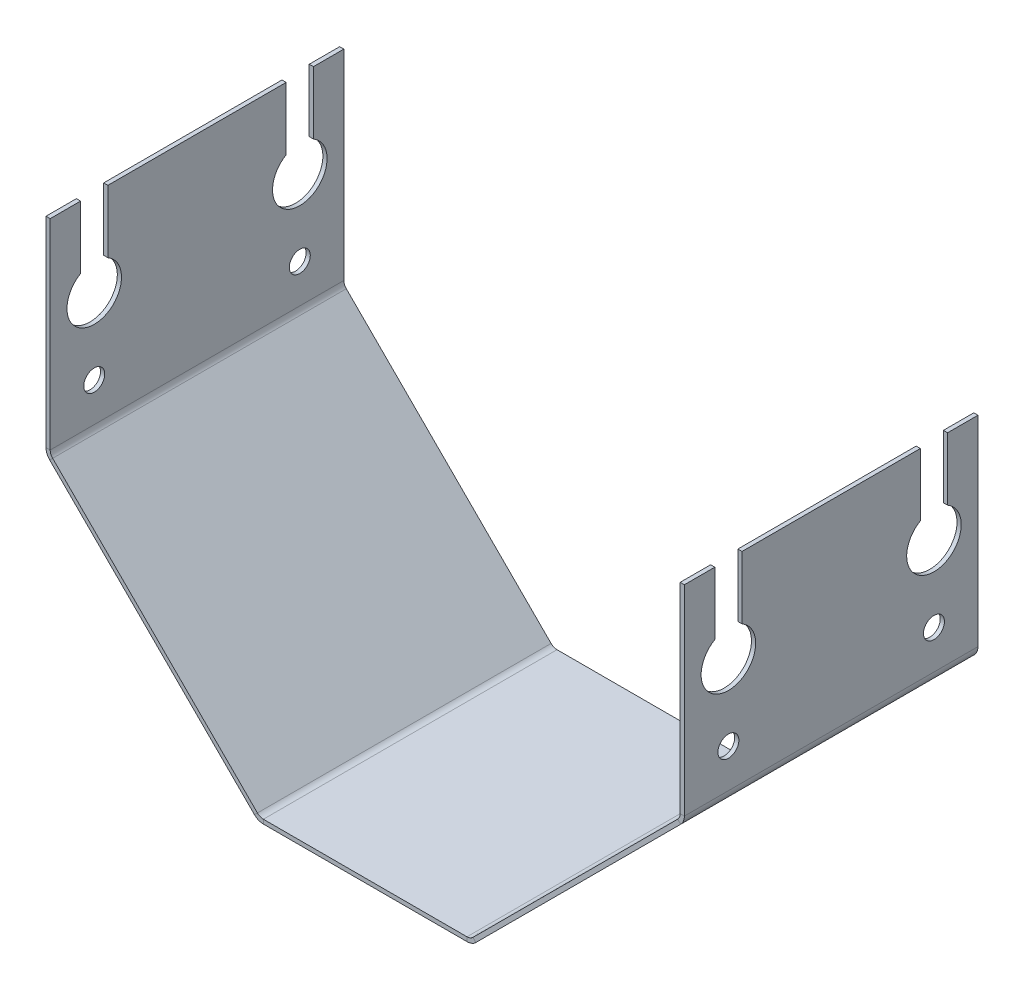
ISO-10303-21;
HEADER;
FILE_DESCRIPTION(('STEP AP214'),'2;1');
FILE_NAME('part.step','',(''),(''),'','','');
FILE_SCHEMA(('AUTOMOTIVE_DESIGN { 1 0 10303 214 1 1 1 1 }'));
ENDSEC;
DATA;
#1=APPLICATION_CONTEXT('core data for automotive mechanical design processes');
#2=APPLICATION_PROTOCOL_DEFINITION('international standard','automotive_design',2000,#1);
#3=PRODUCT_CONTEXT('',#1,'mechanical');
#4=PRODUCT('Part','Part','',(#3));
#5=PRODUCT_RELATED_PRODUCT_CATEGORY('part','',(#4));
#6=PRODUCT_DEFINITION_FORMATION('','',#4);
#7=PRODUCT_DEFINITION_CONTEXT('part definition',#1,'design');
#8=PRODUCT_DEFINITION('design','',#6,#7);
#9=PRODUCT_DEFINITION_SHAPE('','',#8);
#10=(LENGTH_UNIT() NAMED_UNIT(*) SI_UNIT(.MILLI.,.METRE.));
#11=(NAMED_UNIT(*) PLANE_ANGLE_UNIT() SI_UNIT($,.RADIAN.));
#12=(NAMED_UNIT(*) SI_UNIT($,.STERADIAN.) SOLID_ANGLE_UNIT());
#13=UNCERTAINTY_MEASURE_WITH_UNIT(LENGTH_MEASURE(1.E-05),#10,'distance_accuracy_value','');
#14=(GEOMETRIC_REPRESENTATION_CONTEXT(3) GLOBAL_UNCERTAINTY_ASSIGNED_CONTEXT((#13)) GLOBAL_UNIT_ASSIGNED_CONTEXT((#10,
#11,#12)) REPRESENTATION_CONTEXT('',''));
#15=CARTESIAN_POINT('',(0.,0.,0.));
#16=DIRECTION('',(0.,0.,1.));
#17=DIRECTION('',(1.,0.,0.));
#18=AXIS2_PLACEMENT_3D('',#15,#16,#17);
#19=CARTESIAN_POINT('',(68.9155671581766,98.5844328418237,0.));
#20=DIRECTION('',(0.,1.,0.));
#21=DIRECTION('',(0.,0.,1.));
#22=AXIS2_PLACEMENT_3D('',#19,#20,#21);
#23=PLANE('',#22);
#24=DIRECTION('',(-1.,0.,0.));
#25=VECTOR('',#24,1.);
#26=CARTESIAN_POINT('',(221.084432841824,98.5844328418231,-56.25));
#27=LINE('',#26,#25);
#28=CARTESIAN_POINT('',(69.9155671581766,98.5844328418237,-56.25));
#29=VERTEX_POINT('',#28);
#30=CARTESIAN_POINT('',(68.9155671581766,98.5844328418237,-56.25));
#31=VERTEX_POINT('',#30);
#32=EDGE_CURVE('E321',#29,#31,#27,.T.);
#33=ORIENTED_EDGE('',*,*,#32,.T.);
#34=DIRECTION('',(0.,0.,1.));
#35=VECTOR('',#34,1.);
#36=CARTESIAN_POINT('',(68.9155671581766,98.5844328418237,0.));
#37=LINE('',#36,#35);
#38=CARTESIAN_POINT('',(68.9155671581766,98.5844328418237,-13.75));
#39=VERTEX_POINT('',#38);
#40=EDGE_CURVE('E477',#31,#39,#37,.T.);
#41=ORIENTED_EDGE('',*,*,#40,.T.);
#42=DIRECTION('',(-1.,0.,0.));
#43=VECTOR('',#42,1.);
#44=CARTESIAN_POINT('',(221.084432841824,98.5844328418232,-13.75));
#45=LINE('',#44,#43);
#46=CARTESIAN_POINT('',(69.9155671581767,98.5844328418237,-13.75));
#47=VERTEX_POINT('',#46);
#48=EDGE_CURVE('E310',#47,#39,#45,.T.);
#49=ORIENTED_EDGE('',*,*,#48,.F.);
#50=DIRECTION('',(0.,0.,1.));
#51=VECTOR('',#50,1.);
#52=CARTESIAN_POINT('',(69.9155671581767,98.5844328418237,0.));
#53=LINE('',#52,#51);
#54=EDGE_CURVE('E459',#29,#47,#53,.T.);
#55=ORIENTED_EDGE('',*,*,#54,.F.);
#56=EDGE_LOOP('',(#33,#41,#49,#55));
#57=FACE_BOUND('',#56,.T.);
#58=ADVANCED_FACE('F59',(#57),#23,.T.);
#59=DIRECTION('',(-1.,0.,0.));
#60=VECTOR('',#59,1.);
#61=CARTESIAN_POINT('',(221.084432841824,98.5844328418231,-62.75));
#62=LINE('',#61,#60);
#63=CARTESIAN_POINT('',(69.9155671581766,98.5844328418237,-62.75));
#64=VERTEX_POINT('',#63);
#65=CARTESIAN_POINT('',(68.9155671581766,98.5844328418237,-62.75));
#66=VERTEX_POINT('',#65);
#67=EDGE_CURVE('E348',#64,#66,#62,.T.);
#68=ORIENTED_EDGE('',*,*,#67,.F.);
#69=CARTESIAN_POINT('',(69.9155671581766,98.5844328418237,-70.));
#70=VERTEX_POINT('',#69);
#71=EDGE_CURVE('E456',#70,#64,#53,.T.);
#72=ORIENTED_EDGE('',*,*,#71,.F.);
#73=DIRECTION('',(1.,0.,0.));
#74=VECTOR('',#73,1.);
#75=CARTESIAN_POINT('',(68.9155671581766,98.5844328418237,-70.));
#76=LINE('',#75,#74);
#77=CARTESIAN_POINT('',(68.9155671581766,98.5844328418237,-70.));
#78=VERTEX_POINT('',#77);
#79=EDGE_CURVE('E446',#78,#70,#76,.T.);
#80=ORIENTED_EDGE('',*,*,#79,.F.);
#81=EDGE_CURVE('E474',#78,#66,#37,.T.);
#82=ORIENTED_EDGE('',*,*,#81,.T.);
#83=EDGE_LOOP('',(#68,#72,#80,#82));
#84=FACE_BOUND('',#83,.T.);
#85=ADVANCED_FACE('F743',(#84),#23,.T.);
#86=CARTESIAN_POINT('',(221.084432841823,98.5844328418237,0.));
#87=DIRECTION('',(0.,1.,0.));
#88=DIRECTION('',(0.,0.,-1.));
#89=AXIS2_PLACEMENT_3D('',#86,#87,#88);
#90=PLANE('',#89);
#91=CARTESIAN_POINT('',(221.084432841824,98.5844328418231,-56.25));
#92=VERTEX_POINT('',#91);
#93=CARTESIAN_POINT('',(220.084432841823,98.5844328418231,-56.25));
#94=VERTEX_POINT('',#93);
#95=EDGE_CURVE('E324',#92,#94,#27,.T.);
#96=ORIENTED_EDGE('',*,*,#95,.T.);
#97=DIRECTION('',(0.,0.,-1.));
#98=VECTOR('',#97,1.);
#99=CARTESIAN_POINT('',(220.084432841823,98.5844328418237,0.));
#100=LINE('',#99,#98);
#101=CARTESIAN_POINT('',(220.084432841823,98.5844328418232,-13.75));
#102=VERTEX_POINT('',#101);
#103=EDGE_CURVE('E407',#102,#94,#100,.T.);
#104=ORIENTED_EDGE('',*,*,#103,.F.);
#105=CARTESIAN_POINT('',(221.084432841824,98.5844328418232,-13.75));
#106=VERTEX_POINT('',#105);
#107=EDGE_CURVE('E658',#106,#102,#45,.T.);
#108=ORIENTED_EDGE('',*,*,#107,.F.);
#109=DIRECTION('',(0.,0.,-1.));
#110=VECTOR('',#109,1.);
#111=CARTESIAN_POINT('',(221.084432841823,98.5844328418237,0.));
#112=LINE('',#111,#110);
#113=EDGE_CURVE('E425',#106,#92,#112,.T.);
#114=ORIENTED_EDGE('',*,*,#113,.T.);
#115=EDGE_LOOP('',(#96,#104,#108,#114));
#116=FACE_BOUND('',#115,.T.);
#117=ADVANCED_FACE('F657',(#116),#90,.T.);
#118=CARTESIAN_POINT('',(221.084432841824,98.5844328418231,-62.75));
#119=VERTEX_POINT('',#118);
#120=CARTESIAN_POINT('',(220.084432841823,98.5844328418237,-62.75));
#121=VERTEX_POINT('',#120);
#122=EDGE_CURVE('E345',#119,#121,#62,.T.);
#123=ORIENTED_EDGE('',*,*,#122,.F.);
#124=CARTESIAN_POINT('',(221.084432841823,98.5844328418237,-70.));
#125=VERTEX_POINT('',#124);
#126=EDGE_CURVE('E426',#119,#125,#112,.T.);
#127=ORIENTED_EDGE('',*,*,#126,.T.);
#128=DIRECTION('',(-1.,0.,0.));
#129=VECTOR('',#128,1.);
#130=CARTESIAN_POINT('',(221.084432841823,98.5844328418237,-70.));
#131=LINE('',#130,#129);
#132=CARTESIAN_POINT('',(220.084432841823,98.5844328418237,-70.));
#133=VERTEX_POINT('',#132);
#134=EDGE_CURVE('E419',#125,#133,#131,.T.);
#135=ORIENTED_EDGE('',*,*,#134,.T.);
#136=EDGE_CURVE('E408',#121,#133,#100,.T.);
#137=ORIENTED_EDGE('',*,*,#136,.F.);
#138=EDGE_LOOP('',(#123,#127,#135,#137));
#139=FACE_BOUND('',#138,.T.);
#140=ADVANCED_FACE('F651',(#139),#90,.T.);
#141=CARTESIAN_POINT('',(0.,-1.,-70.));
#142=DIRECTION('',(0.,0.,-1.));
#143=DIRECTION('',(-1.,0.,0.));
#144=AXIS2_PLACEMENT_3D('',#141,#142,#143);
#145=PLANE('',#144);
#146=DIRECTION('',(-1.,0.,0.));
#147=VECTOR('',#146,1.);
#148=CARTESIAN_POINT('',(0.,0.,-70.));
#149=LINE('',#148,#147);
#150=CARTESIAN_POINT('',(169.268252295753,0.,-70.));
#151=VERTEX_POINT('',#150);
#152=CARTESIAN_POINT('',(120.731747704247,0.,-70.));
#153=VERTEX_POINT('',#152);
#154=EDGE_CURVE('E576',#151,#153,#149,.T.);
#155=ORIENTED_EDGE('',*,*,#154,.F.);
#156=DIRECTION('',(0.,-1.,0.));
#157=VECTOR('',#156,1.);
#158=CARTESIAN_POINT('',(169.268252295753,-1.,-70.));
#159=LINE('',#158,#157);
#160=CARTESIAN_POINT('',(169.268252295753,-1.,-70.));
#161=VERTEX_POINT('',#160);
#162=EDGE_CURVE('E563',#151,#161,#159,.T.);
#163=ORIENTED_EDGE('',*,*,#162,.T.);
#164=DIRECTION('',(-1.,0.,0.));
#165=VECTOR('',#164,1.);
#166=CARTESIAN_POINT('',(0.,-1.,-70.));
#167=LINE('',#166,#165);
#168=CARTESIAN_POINT('',(120.731747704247,-1.,-70.));
#169=VERTEX_POINT('',#168);
#170=EDGE_CURVE('E551',#161,#169,#167,.T.);
#171=ORIENTED_EDGE('',*,*,#170,.T.);
#172=DIRECTION('',(0.,-1.,0.));
#173=VECTOR('',#172,1.);
#174=CARTESIAN_POINT('',(120.731747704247,-1.,-70.));
#175=LINE('',#174,#173);
#176=EDGE_CURVE('E557',#153,#169,#175,.T.);
#177=ORIENTED_EDGE('',*,*,#176,.F.);
#178=EDGE_LOOP('',(#155,#163,#171,#177));
#179=FACE_BOUND('',#178,.T.);
#180=ADVANCED_FACE('F830',(#179),#145,.T.);
#181=CARTESIAN_POINT('',(0.,-1.,0.));
#182=DIRECTION('',(0.,0.,1.));
#183=DIRECTION('',(1.,0.,0.));
#184=AXIS2_PLACEMENT_3D('',#181,#182,#183);
#185=PLANE('',#184);
#186=DIRECTION('',(1.,0.,0.));
#187=VECTOR('',#186,1.);
#188=CARTESIAN_POINT('',(0.,-1.,0.));
#189=LINE('',#188,#187);
#190=CARTESIAN_POINT('',(120.731747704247,-1.,0.));
#191=VERTEX_POINT('',#190);
#192=CARTESIAN_POINT('',(169.268252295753,-1.,0.));
#193=VERTEX_POINT('',#192);
#194=EDGE_CURVE('E573',#191,#193,#189,.T.);
#195=ORIENTED_EDGE('',*,*,#194,.T.);
#196=DIRECTION('',(0.,1.,0.));
#197=VECTOR('',#196,1.);
#198=CARTESIAN_POINT('',(169.268252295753,-1.,0.));
#199=LINE('',#198,#197);
#200=CARTESIAN_POINT('',(169.268252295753,0.,0.));
#201=VERTEX_POINT('',#200);
#202=EDGE_CURVE('E569',#193,#201,#199,.T.);
#203=ORIENTED_EDGE('',*,*,#202,.T.);
#204=DIRECTION('',(1.,0.,0.));
#205=VECTOR('',#204,1.);
#206=CARTESIAN_POINT('',(0.,0.,0.));
#207=LINE('',#206,#205);
#208=CARTESIAN_POINT('',(120.731747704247,0.,0.));
#209=VERTEX_POINT('',#208);
#210=EDGE_CURVE('E541',#209,#201,#207,.T.);
#211=ORIENTED_EDGE('',*,*,#210,.F.);
#212=DIRECTION('',(0.,1.,0.));
#213=VECTOR('',#212,1.);
#214=CARTESIAN_POINT('',(120.731747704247,-1.,0.));
#215=LINE('',#214,#213);
#216=EDGE_CURVE('E550',#191,#209,#215,.T.);
#217=ORIENTED_EDGE('',*,*,#216,.F.);
#218=EDGE_LOOP('',(#195,#203,#211,#217));
#219=FACE_BOUND('',#218,.T.);
#220=ADVANCED_FACE('F702',(#219),#185,.T.);
#221=CARTESIAN_POINT('',(0.,-1.,0.));
#222=DIRECTION('',(0.,-1.,0.));
#223=DIRECTION('',(0.,0.,-1.));
#224=AXIS2_PLACEMENT_3D('',#221,#222,#223);
#225=PLANE('',#224);
#226=ORIENTED_EDGE('',*,*,#170,.F.);
#227=DIRECTION('',(0.,0.,1.));
#228=VECTOR('',#227,1.);
#229=CARTESIAN_POINT('',(169.268252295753,-1.,0.));
#230=LINE('',#229,#228);
#231=EDGE_CURVE('E560',#161,#193,#230,.T.);
#232=ORIENTED_EDGE('',*,*,#231,.T.);
#233=ORIENTED_EDGE('',*,*,#194,.F.);
#234=DIRECTION('',(0.,0.,1.));
#235=VECTOR('',#234,1.);
#236=CARTESIAN_POINT('',(120.731747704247,-1.,0.));
#237=LINE('',#236,#235);
#238=EDGE_CURVE('E547',#169,#191,#237,.T.);
#239=ORIENTED_EDGE('',*,*,#238,.F.);
#240=EDGE_LOOP('',(#226,#232,#233,#239));
#241=FACE_BOUND('',#240,.T.);
#242=ADVANCED_FACE('F706',(#241),#225,.T.);
#243=CARTESIAN_POINT('',(0.,0.,0.));
#244=DIRECTION('',(0.,-1.,0.));
#245=DIRECTION('',(0.,0.,-1.));
#246=AXIS2_PLACEMENT_3D('',#243,#244,#245);
#247=PLANE('',#246);
#248=DIRECTION('',(0.,0.,1.));
#249=VECTOR('',#248,1.);
#250=CARTESIAN_POINT('',(169.268252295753,0.,0.));
#251=LINE('',#250,#249);
#252=EDGE_CURVE('E566',#151,#201,#251,.T.);
#253=ORIENTED_EDGE('',*,*,#252,.F.);
#254=ORIENTED_EDGE('',*,*,#154,.T.);
#255=DIRECTION('',(0.,0.,1.));
#256=VECTOR('',#255,1.);
#257=CARTESIAN_POINT('',(120.731747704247,0.,0.));
#258=LINE('',#257,#256);
#259=EDGE_CURVE('E554',#153,#209,#258,.T.);
#260=ORIENTED_EDGE('',*,*,#259,.T.);
#261=ORIENTED_EDGE('',*,*,#210,.T.);
#262=EDGE_LOOP('',(#253,#254,#260,#261));
#263=FACE_BOUND('',#262,.T.);
#264=ADVANCED_FACE('F835',(#263),#247,.F.);
#265=CARTESIAN_POINT('',(120.731747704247,2.,-70.));
#266=DIRECTION('',(0.,0.,-1.));
#267=DIRECTION('',(-1.,0.,0.));
#268=AXIS2_PLACEMENT_3D('',#265,#266,#267);
#269=PLANE('',#268);
#270=DIRECTION('',(-0.707106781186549,-0.707106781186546,0.));
#271=VECTOR('',#270,1.);
#272=CARTESIAN_POINT('',(118.610427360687,-0.121320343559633,-70.));
#273=LINE('',#272,#271);
#274=CARTESIAN_POINT('',(119.317534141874,0.585786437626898,-70.));
#275=VERTEX_POINT('',#274);
#276=CARTESIAN_POINT('',(118.610427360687,-0.121320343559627,-70.));
#277=VERTEX_POINT('',#276);
#278=EDGE_CURVE('E520',#275,#277,#273,.T.);
#279=ORIENTED_EDGE('',*,*,#278,.F.);
#280=CARTESIAN_POINT('',(120.731747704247,2.,-70.));
#281=DIRECTION('',(0.,0.,-1.));
#282=DIRECTION('',(-1.,0.,0.));
#283=AXIS2_PLACEMENT_3D('',#280,#281,#282);
#284=CIRCLE('',#283,2.);
#285=EDGE_CURVE('E542',#275,#153,#284,.F.);
#286=ORIENTED_EDGE('',*,*,#285,.T.);
#287=ORIENTED_EDGE('',*,*,#176,.T.);
#288=CARTESIAN_POINT('',(120.731747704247,2.,-70.));
#289=DIRECTION('',(0.,0.,1.));
#290=DIRECTION('',(-1.,0.,0.));
#291=AXIS2_PLACEMENT_3D('',#288,#289,#290);
#292=CIRCLE('',#291,3.);
#293=EDGE_CURVE('E534',#277,#169,#292,.T.);
#294=ORIENTED_EDGE('',*,*,#293,.F.);
#295=EDGE_LOOP('',(#279,#286,#287,#294));
#296=FACE_BOUND('',#295,.T.);
#297=ADVANCED_FACE('F825',(#296),#269,.T.);
#298=CARTESIAN_POINT('',(120.731747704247,2.,0.));
#299=DIRECTION('',(0.,0.,1.));
#300=DIRECTION('',(1.,0.,0.));
#301=AXIS2_PLACEMENT_3D('',#298,#299,#300);
#302=PLANE('',#301);
#303=CARTESIAN_POINT('',(120.731747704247,2.,0.));
#304=DIRECTION('',(0.,0.,-1.));
#305=DIRECTION('',(-1.,0.,0.));
#306=AXIS2_PLACEMENT_3D('',#303,#304,#305);
#307=CIRCLE('',#306,2.);
#308=CARTESIAN_POINT('',(119.317534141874,0.585786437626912,0.));
#309=VERTEX_POINT('',#308);
#310=EDGE_CURVE('E538',#209,#309,#307,.T.);
#311=ORIENTED_EDGE('',*,*,#310,.T.);
#312=DIRECTION('',(0.707106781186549,0.707106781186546,0.));
#313=VECTOR('',#312,1.);
#314=CARTESIAN_POINT('',(118.610427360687,-0.121320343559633,0.));
#315=LINE('',#314,#313);
#316=CARTESIAN_POINT('',(118.610427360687,-0.121320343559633,0.));
#317=VERTEX_POINT('',#316);
#318=EDGE_CURVE('E524',#317,#309,#315,.T.);
#319=ORIENTED_EDGE('',*,*,#318,.F.);
#320=CARTESIAN_POINT('',(120.731747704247,2.,0.));
#321=DIRECTION('',(0.,0.,-1.));
#322=DIRECTION('',(1.,0.,0.));
#323=AXIS2_PLACEMENT_3D('',#320,#321,#322);
#324=CIRCLE('',#323,3.);
#325=EDGE_CURVE('E537',#191,#317,#324,.T.);
#326=ORIENTED_EDGE('',*,*,#325,.F.);
#327=ORIENTED_EDGE('',*,*,#216,.T.);
#328=EDGE_LOOP('',(#311,#319,#326,#327));
#329=FACE_BOUND('',#328,.T.);
#330=ADVANCED_FACE('F820',(#329),#302,.T.);
#331=CARTESIAN_POINT('',(120.731747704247,2.,35.0346722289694));
#332=DIRECTION('',(0.,0.,-1.));
#333=DIRECTION('',(-1.,0.,0.));
#334=AXIS2_PLACEMENT_3D('',#331,#332,#333);
#335=CYLINDRICAL_SURFACE('',#334,3.);
#336=ORIENTED_EDGE('',*,*,#238,.T.);
#337=ORIENTED_EDGE('',*,*,#325,.T.);
#338=DIRECTION('',(0.,0.,1.));
#339=VECTOR('',#338,1.);
#340=CARTESIAN_POINT('',(118.610427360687,-0.121320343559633,0.));
#341=LINE('',#340,#339);
#342=EDGE_CURVE('E529',#277,#317,#341,.T.);
#343=ORIENTED_EDGE('',*,*,#342,.F.);
#344=ORIENTED_EDGE('',*,*,#293,.T.);
#345=EDGE_LOOP('',(#336,#337,#343,#344));
#346=FACE_BOUND('',#345,.T.);
#347=ADVANCED_FACE('F822',(#346),#335,.T.);
#348=CARTESIAN_POINT('',(120.731747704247,2.,35.0346722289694));
#349=DIRECTION('',(0.,0.,-1.));
#350=DIRECTION('',(-1.,0.,0.));
#351=AXIS2_PLACEMENT_3D('',#348,#349,#350);
#352=CYLINDRICAL_SURFACE('',#351,2.);
#353=ORIENTED_EDGE('',*,*,#259,.F.);
#354=ORIENTED_EDGE('',*,*,#285,.F.);
#355=DIRECTION('',(0.,0.,1.));
#356=VECTOR('',#355,1.);
#357=CARTESIAN_POINT('',(119.317534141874,0.585786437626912,0.));
#358=LINE('',#357,#356);
#359=EDGE_CURVE('E514',#275,#309,#358,.T.);
#360=ORIENTED_EDGE('',*,*,#359,.T.);
#361=ORIENTED_EDGE('',*,*,#310,.F.);
#362=EDGE_LOOP('',(#353,#354,#360,#361));
#363=FACE_BOUND('',#362,.T.);
#364=ADVANCED_FACE('F833',(#363),#352,.F.);
#365=CARTESIAN_POINT('',(34.6285907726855,83.8605162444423,0.));
#366=DIRECTION('',(-0.707106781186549,-0.707106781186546,0.));
#367=DIRECTION('',(0.,0.,-1.));
#368=AXIS2_PLACEMENT_3D('',#365,#366,#367);
#369=PLANE('',#368);
#370=DIRECTION('',(0.,0.,1.));
#371=VECTOR('',#370,1.);
#372=CARTESIAN_POINT('',(69.7942468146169,48.6948602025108,0.));
#373=LINE('',#372,#371);
#374=CARTESIAN_POINT('',(69.7942468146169,48.6948602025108,-70.));
#375=VERTEX_POINT('',#374);
#376=CARTESIAN_POINT('',(69.7942468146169,48.6948602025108,0.));
#377=VERTEX_POINT('',#376);
#378=EDGE_CURVE('E572',#375,#377,#373,.T.);
#379=ORIENTED_EDGE('',*,*,#378,.F.);
#380=DIRECTION('',(-0.707106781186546,0.707106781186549,0.));
#381=VECTOR('',#380,1.);
#382=CARTESIAN_POINT('',(34.6285907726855,83.8605162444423,-70.));
#383=LINE('',#382,#381);
#384=EDGE_CURVE('E522',#277,#375,#383,.T.);
#385=ORIENTED_EDGE('',*,*,#384,.F.);
#386=ORIENTED_EDGE('',*,*,#342,.T.);
#387=DIRECTION('',(0.707106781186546,-0.707106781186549,0.));
#388=VECTOR('',#387,1.);
#389=CARTESIAN_POINT('',(34.6285907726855,83.8605162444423,0.));
#390=LINE('',#389,#388);
#391=EDGE_CURVE('E528',#377,#317,#390,.T.);
#392=ORIENTED_EDGE('',*,*,#391,.F.);
#393=EDGE_LOOP('',(#379,#385,#386,#392));
#394=FACE_BOUND('',#393,.T.);
#395=ADVANCED_FACE('F813',(#394),#369,.T.);
#396=CARTESIAN_POINT('',(34.6285907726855,83.8605162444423,0.));
#397=DIRECTION('',(0.,0.,1.));
#398=DIRECTION('',(0.707106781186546,-0.707106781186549,0.));
#399=AXIS2_PLACEMENT_3D('',#396,#397,#398);
#400=PLANE('',#399);
#401=DIRECTION('',(0.707106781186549,0.707106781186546,0.));
#402=VECTOR('',#401,1.);
#403=CARTESIAN_POINT('',(69.7942468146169,48.6948602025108,0.));
#404=LINE('',#403,#402);
#405=CARTESIAN_POINT('',(70.5013535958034,49.4019669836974,0.));
#406=VERTEX_POINT('',#405);
#407=EDGE_CURVE('E584',#377,#406,#404,.T.);
#408=ORIENTED_EDGE('',*,*,#407,.F.);
#409=ORIENTED_EDGE('',*,*,#391,.T.);
#410=ORIENTED_EDGE('',*,*,#318,.T.);
#411=DIRECTION('',(0.707106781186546,-0.707106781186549,0.));
#412=VECTOR('',#411,1.);
#413=CARTESIAN_POINT('',(35.335697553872,84.5676230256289,0.));
#414=LINE('',#413,#412);
#415=EDGE_CURVE('E523',#406,#309,#414,.T.);
#416=ORIENTED_EDGE('',*,*,#415,.F.);
#417=EDGE_LOOP('',(#408,#409,#410,#416));
#418=FACE_BOUND('',#417,.T.);
#419=ADVANCED_FACE('F811',(#418),#400,.T.);
#420=CARTESIAN_POINT('',(35.335697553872,84.5676230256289,0.));
#421=DIRECTION('',(-0.707106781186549,-0.707106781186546,0.));
#422=DIRECTION('',(0.,0.,-1.));
#423=AXIS2_PLACEMENT_3D('',#420,#421,#422);
#424=PLANE('',#423);
#425=DIRECTION('',(-0.707106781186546,0.707106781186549,0.));
#426=VECTOR('',#425,1.);
#427=CARTESIAN_POINT('',(35.335697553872,84.5676230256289,-70.));
#428=LINE('',#427,#426);
#429=CARTESIAN_POINT('',(70.5013535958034,49.4019669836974,-70.));
#430=VERTEX_POINT('',#429);
#431=EDGE_CURVE('E527',#275,#430,#428,.T.);
#432=ORIENTED_EDGE('',*,*,#431,.T.);
#433=DIRECTION('',(0.,0.,1.));
#434=VECTOR('',#433,1.);
#435=CARTESIAN_POINT('',(70.5013535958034,49.4019669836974,0.));
#436=LINE('',#435,#434);
#437=EDGE_CURVE('E587',#430,#406,#436,.T.);
#438=ORIENTED_EDGE('',*,*,#437,.T.);
#439=ORIENTED_EDGE('',*,*,#415,.T.);
#440=ORIENTED_EDGE('',*,*,#359,.F.);
#441=EDGE_LOOP('',(#432,#438,#439,#440));
#442=FACE_BOUND('',#441,.T.);
#443=ADVANCED_FACE('F805',(#442),#424,.F.);
#444=CARTESIAN_POINT('',(34.6285907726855,83.8605162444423,-70.));
#445=DIRECTION('',(0.,0.,-1.));
#446=DIRECTION('',(-0.707106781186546,0.707106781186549,0.));
#447=AXIS2_PLACEMENT_3D('',#444,#445,#446);
#448=PLANE('',#447);
#449=DIRECTION('',(-0.707106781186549,-0.707106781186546,0.));
#450=VECTOR('',#449,1.);
#451=CARTESIAN_POINT('',(69.7942468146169,48.6948602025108,-70.));
#452=LINE('',#451,#450);
#453=EDGE_CURVE('E590',#430,#375,#452,.T.);
#454=ORIENTED_EDGE('',*,*,#453,.F.);
#455=ORIENTED_EDGE('',*,*,#431,.F.);
#456=ORIENTED_EDGE('',*,*,#278,.T.);
#457=ORIENTED_EDGE('',*,*,#384,.T.);
#458=EDGE_LOOP('',(#454,#455,#456,#457));
#459=FACE_BOUND('',#458,.T.);
#460=ADVANCED_FACE('F799',(#459),#448,.T.);
#461=CARTESIAN_POINT('',(169.268252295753,2.,-70.));
#462=DIRECTION('',(0.,0.,-1.));
#463=DIRECTION('',(-1.,0.,0.));
#464=AXIS2_PLACEMENT_3D('',#461,#462,#463);
#465=PLANE('',#464);
#466=ORIENTED_EDGE('',*,*,#162,.F.);
#467=CARTESIAN_POINT('',(169.268252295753,2.,-70.));
#468=DIRECTION('',(0.,0.,1.));
#469=DIRECTION('',(1.,0.,0.));
#470=AXIS2_PLACEMENT_3D('',#467,#468,#469);
#471=CIRCLE('',#470,2.);
#472=CARTESIAN_POINT('',(170.682465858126,0.585786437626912,-70.));
#473=VERTEX_POINT('',#472);
#474=EDGE_CURVE('E515',#151,#473,#471,.T.);
#475=ORIENTED_EDGE('',*,*,#474,.T.);
#476=DIRECTION('',(0.707106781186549,-0.707106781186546,0.));
#477=VECTOR('',#476,1.);
#478=CARTESIAN_POINT('',(171.389572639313,-0.121320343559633,-70.));
#479=LINE('',#478,#477);
#480=CARTESIAN_POINT('',(171.389572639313,-0.121320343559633,-70.));
#481=VERTEX_POINT('',#480);
#482=EDGE_CURVE('E498',#473,#481,#479,.T.);
#483=ORIENTED_EDGE('',*,*,#482,.T.);
#484=CARTESIAN_POINT('',(169.268252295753,2.,-70.));
#485=DIRECTION('',(0.,0.,1.));
#486=DIRECTION('',(-1.,0.,0.));
#487=AXIS2_PLACEMENT_3D('',#484,#485,#486);
#488=CIRCLE('',#487,3.);
#489=EDGE_CURVE('E507',#161,#481,#488,.T.);
#490=ORIENTED_EDGE('',*,*,#489,.F.);
#491=EDGE_LOOP('',(#466,#475,#483,#490));
#492=FACE_BOUND('',#491,.T.);
#493=ADVANCED_FACE('F708',(#492),#465,.T.);
#494=CARTESIAN_POINT('',(169.268252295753,2.,0.));
#495=DIRECTION('',(0.,0.,1.));
#496=DIRECTION('',(1.,0.,0.));
#497=AXIS2_PLACEMENT_3D('',#494,#495,#496);
#498=PLANE('',#497);
#499=CARTESIAN_POINT('',(169.268252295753,2.,0.));
#500=DIRECTION('',(0.,0.,1.));
#501=DIRECTION('',(1.,0.,0.));
#502=AXIS2_PLACEMENT_3D('',#499,#500,#501);
#503=CIRCLE('',#502,2.);
#504=CARTESIAN_POINT('',(170.682465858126,0.585786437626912,0.));
#505=VERTEX_POINT('',#504);
#506=EDGE_CURVE('E511',#505,#201,#503,.F.);
#507=ORIENTED_EDGE('',*,*,#506,.T.);
#508=ORIENTED_EDGE('',*,*,#202,.F.);
#509=CARTESIAN_POINT('',(169.268252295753,2.,0.));
#510=DIRECTION('',(0.,0.,-1.));
#511=DIRECTION('',(1.,0.,0.));
#512=AXIS2_PLACEMENT_3D('',#509,#510,#511);
#513=CIRCLE('',#512,3.);
#514=CARTESIAN_POINT('',(171.389572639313,-0.121320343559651,0.));
#515=VERTEX_POINT('',#514);
#516=EDGE_CURVE('E510',#515,#193,#513,.T.);
#517=ORIENTED_EDGE('',*,*,#516,.F.);
#518=DIRECTION('',(-0.707106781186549,0.707106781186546,0.));
#519=VECTOR('',#518,1.);
#520=CARTESIAN_POINT('',(171.389572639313,-0.121320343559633,0.));
#521=LINE('',#520,#519);
#522=EDGE_CURVE('E502',#515,#505,#521,.T.);
#523=ORIENTED_EDGE('',*,*,#522,.T.);
#524=EDGE_LOOP('',(#507,#508,#517,#523));
#525=FACE_BOUND('',#524,.T.);
#526=ADVANCED_FACE('F699',(#525),#498,.T.);
#527=CARTESIAN_POINT('',(169.268252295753,2.,-105.034672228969));
#528=DIRECTION('',(0.,0.,1.));
#529=DIRECTION('',(1.,0.,0.));
#530=AXIS2_PLACEMENT_3D('',#527,#528,#529);
#531=CYLINDRICAL_SURFACE('',#530,3.);
#532=DIRECTION('',(0.,0.,1.));
#533=VECTOR('',#532,1.);
#534=CARTESIAN_POINT('',(171.389572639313,-0.121320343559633,0.));
#535=LINE('',#534,#533);
#536=EDGE_CURVE('E488',#481,#515,#535,.T.);
#537=ORIENTED_EDGE('',*,*,#536,.T.);
#538=ORIENTED_EDGE('',*,*,#516,.T.);
#539=ORIENTED_EDGE('',*,*,#231,.F.);
#540=ORIENTED_EDGE('',*,*,#489,.T.);
#541=EDGE_LOOP('',(#537,#538,#539,#540));
#542=FACE_BOUND('',#541,.T.);
#543=ADVANCED_FACE('F696',(#542),#531,.T.);
#544=CARTESIAN_POINT('',(169.268252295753,2.,-105.034672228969));
#545=DIRECTION('',(0.,0.,1.));
#546=DIRECTION('',(1.,0.,0.));
#547=AXIS2_PLACEMENT_3D('',#544,#545,#546);
#548=CYLINDRICAL_SURFACE('',#547,2.);
#549=DIRECTION('',(0.,0.,1.));
#550=VECTOR('',#549,1.);
#551=CARTESIAN_POINT('',(170.682465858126,0.585786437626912,0.));
#552=LINE('',#551,#550);
#553=EDGE_CURVE('E493',#473,#505,#552,.T.);
#554=ORIENTED_EDGE('',*,*,#553,.F.);
#555=ORIENTED_EDGE('',*,*,#474,.F.);
#556=ORIENTED_EDGE('',*,*,#252,.T.);
#557=ORIENTED_EDGE('',*,*,#506,.F.);
#558=EDGE_LOOP('',(#554,#555,#556,#557));
#559=FACE_BOUND('',#558,.T.);
#560=ADVANCED_FACE('F717',(#559),#548,.F.);
#561=CARTESIAN_POINT('',(50.310442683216,-121.200450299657,0.));
#562=DIRECTION('',(0.707106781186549,-0.707106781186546,0.));
#563=DIRECTION('',(0.,0.,-1.));
#564=AXIS2_PLACEMENT_3D('',#561,#562,#563);
#565=PLANE('',#564);
#566=DIRECTION('',(-0.707106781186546,-0.707106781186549,0.));
#567=VECTOR('',#566,1.);
#568=CARTESIAN_POINT('',(50.310442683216,-121.200450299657,-70.));
#569=LINE('',#568,#567);
#570=CARTESIAN_POINT('',(220.205753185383,48.6948602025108,-70.));
#571=VERTEX_POINT('',#570);
#572=EDGE_CURVE('E501',#571,#481,#569,.T.);
#573=ORIENTED_EDGE('',*,*,#572,.F.);
#574=DIRECTION('',(0.,0.,1.));
#575=VECTOR('',#574,1.);
#576=CARTESIAN_POINT('',(220.205753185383,48.6948602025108,0.));
#577=LINE('',#576,#575);
#578=CARTESIAN_POINT('',(220.205753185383,48.6948602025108,0.));
#579=VERTEX_POINT('',#578);
#580=EDGE_CURVE('E593',#571,#579,#577,.T.);
#581=ORIENTED_EDGE('',*,*,#580,.T.);
#582=DIRECTION('',(0.707106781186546,0.707106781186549,0.));
#583=VECTOR('',#582,1.);
#584=CARTESIAN_POINT('',(50.310442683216,-121.200450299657,0.));
#585=LINE('',#584,#583);
#586=EDGE_CURVE('E518',#515,#579,#585,.T.);
#587=ORIENTED_EDGE('',*,*,#586,.F.);
#588=ORIENTED_EDGE('',*,*,#536,.F.);
#589=EDGE_LOOP('',(#573,#581,#587,#588));
#590=FACE_BOUND('',#589,.T.);
#591=ADVANCED_FACE('F693',(#590),#565,.T.);
#592=CARTESIAN_POINT('',(50.310442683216,-121.200450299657,-70.));
#593=DIRECTION('',(0.,0.,-1.));
#594=DIRECTION('',(-0.707106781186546,-0.707106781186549,0.));
#595=AXIS2_PLACEMENT_3D('',#592,#593,#594);
#596=PLANE('',#595);
#597=DIRECTION('',(-0.707106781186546,-0.707106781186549,0.));
#598=VECTOR('',#597,1.);
#599=CARTESIAN_POINT('',(49.6033359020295,-120.49334351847,-70.));
#600=LINE('',#599,#598);
#601=CARTESIAN_POINT('',(219.498646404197,49.4019669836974,-70.));
#602=VERTEX_POINT('',#601);
#603=EDGE_CURVE('E497',#602,#473,#600,.T.);
#604=ORIENTED_EDGE('',*,*,#603,.F.);
#605=DIRECTION('',(0.707106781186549,-0.707106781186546,0.));
#606=VECTOR('',#605,1.);
#607=CARTESIAN_POINT('',(220.205753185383,48.6948602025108,-70.));
#608=LINE('',#607,#606);
#609=EDGE_CURVE('E600',#602,#571,#608,.T.);
#610=ORIENTED_EDGE('',*,*,#609,.T.);
#611=ORIENTED_EDGE('',*,*,#572,.T.);
#612=ORIENTED_EDGE('',*,*,#482,.F.);
#613=EDGE_LOOP('',(#604,#610,#611,#612));
#614=FACE_BOUND('',#613,.T.);
#615=ADVANCED_FACE('F714',(#614),#596,.T.);
#616=CARTESIAN_POINT('',(49.6033359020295,-120.49334351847,0.));
#617=DIRECTION('',(0.707106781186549,-0.707106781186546,0.));
#618=DIRECTION('',(0.,0.,-1.));
#619=AXIS2_PLACEMENT_3D('',#616,#617,#618);
#620=PLANE('',#619);
#621=DIRECTION('',(0.,0.,1.));
#622=VECTOR('',#621,1.);
#623=CARTESIAN_POINT('',(219.498646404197,49.4019669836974,0.));
#624=LINE('',#623,#622);
#625=CARTESIAN_POINT('',(219.498646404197,49.4019669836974,0.));
#626=VERTEX_POINT('',#625);
#627=EDGE_CURVE('E603',#602,#626,#624,.T.);
#628=ORIENTED_EDGE('',*,*,#627,.F.);
#629=ORIENTED_EDGE('',*,*,#603,.T.);
#630=ORIENTED_EDGE('',*,*,#553,.T.);
#631=DIRECTION('',(0.707106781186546,0.707106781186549,0.));
#632=VECTOR('',#631,1.);
#633=CARTESIAN_POINT('',(49.6033359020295,-120.49334351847,0.));
#634=LINE('',#633,#632);
#635=EDGE_CURVE('E496',#505,#626,#634,.T.);
#636=ORIENTED_EDGE('',*,*,#635,.T.);
#637=EDGE_LOOP('',(#628,#629,#630,#636));
#638=FACE_BOUND('',#637,.T.);
#639=ADVANCED_FACE('F720',(#638),#620,.F.);
#640=CARTESIAN_POINT('',(50.310442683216,-121.200450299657,0.));
#641=DIRECTION('',(0.,0.,1.));
#642=DIRECTION('',(0.707106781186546,0.707106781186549,0.));
#643=AXIS2_PLACEMENT_3D('',#640,#641,#642);
#644=PLANE('',#643);
#645=ORIENTED_EDGE('',*,*,#586,.T.);
#646=DIRECTION('',(-0.707106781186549,0.707106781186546,0.));
#647=VECTOR('',#646,1.);
#648=CARTESIAN_POINT('',(220.205753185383,48.6948602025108,0.));
#649=LINE('',#648,#647);
#650=EDGE_CURVE('E606',#579,#626,#649,.T.);
#651=ORIENTED_EDGE('',*,*,#650,.T.);
#652=ORIENTED_EDGE('',*,*,#635,.F.);
#653=ORIENTED_EDGE('',*,*,#522,.F.);
#654=EDGE_LOOP('',(#645,#651,#652,#653));
#655=FACE_BOUND('',#654,.T.);
#656=ADVANCED_FACE('F61',(#655),#644,.T.);
#657=CARTESIAN_POINT('',(71.9155671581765,50.8161805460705,-70.));
#658=DIRECTION('',(0.,0.,-1.));
#659=DIRECTION('',(-1.,0.,0.));
#660=AXIS2_PLACEMENT_3D('',#657,#658,#659);
#661=PLANE('',#660);
#662=DIRECTION('',(-1.,0.,0.));
#663=VECTOR('',#662,1.);
#664=CARTESIAN_POINT('',(68.9155671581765,50.8161805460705,-70.));
#665=LINE('',#664,#663);
#666=CARTESIAN_POINT('',(69.9155671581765,50.8161805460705,-70.));
#667=VERTEX_POINT('',#666);
#668=CARTESIAN_POINT('',(68.9155671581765,50.8161805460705,-70.));
#669=VERTEX_POINT('',#668);
#670=EDGE_CURVE('E452',#667,#669,#665,.T.);
#671=ORIENTED_EDGE('',*,*,#670,.F.);
#672=CARTESIAN_POINT('',(71.9155671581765,50.8161805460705,-70.));
#673=DIRECTION('',(0.,0.,-1.));
#674=DIRECTION('',(0.,1.,0.));
#675=AXIS2_PLACEMENT_3D('',#672,#673,#674);
#676=CIRCLE('',#675,2.);
#677=EDGE_CURVE('E449',#667,#430,#676,.F.);
#678=ORIENTED_EDGE('',*,*,#677,.T.);
#679=ORIENTED_EDGE('',*,*,#453,.T.);
#680=CARTESIAN_POINT('',(71.9155671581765,50.8161805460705,-70.));
#681=DIRECTION('',(0.,0.,1.));
#682=DIRECTION('',(-1.,0.,0.));
#683=AXIS2_PLACEMENT_3D('',#680,#681,#682);
#684=CIRCLE('',#683,3.);
#685=EDGE_CURVE('E481',#669,#375,#684,.T.);
#686=ORIENTED_EDGE('',*,*,#685,.F.);
#687=EDGE_LOOP('',(#671,#678,#679,#686));
#688=FACE_BOUND('',#687,.T.);
#689=ADVANCED_FACE('F794',(#688),#661,.T.);
#690=CARTESIAN_POINT('',(71.9155671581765,50.8161805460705,0.));
#691=DIRECTION('',(0.,0.,1.));
#692=DIRECTION('',(1.,0.,0.));
#693=AXIS2_PLACEMENT_3D('',#690,#691,#692);
#694=PLANE('',#693);
#695=CARTESIAN_POINT('',(71.9155671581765,50.8161805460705,0.));
#696=DIRECTION('',(0.,0.,-1.));
#697=DIRECTION('',(0.,1.,0.));
#698=AXIS2_PLACEMENT_3D('',#695,#696,#697);
#699=CIRCLE('',#698,2.);
#700=CARTESIAN_POINT('',(69.9155671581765,50.8161805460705,0.));
#701=VERTEX_POINT('',#700);
#702=EDGE_CURVE('E485',#406,#701,#699,.T.);
#703=ORIENTED_EDGE('',*,*,#702,.T.);
#704=DIRECTION('',(1.,0.,0.));
#705=VECTOR('',#704,1.);
#706=CARTESIAN_POINT('',(68.9155671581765,50.8161805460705,0.));
#707=LINE('',#706,#705);
#708=CARTESIAN_POINT('',(68.9155671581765,50.8161805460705,0.));
#709=VERTEX_POINT('',#708);
#710=EDGE_CURVE('E463',#709,#701,#707,.T.);
#711=ORIENTED_EDGE('',*,*,#710,.F.);
#712=CARTESIAN_POINT('',(71.9155671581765,50.8161805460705,0.));
#713=DIRECTION('',(0.,0.,-1.));
#714=DIRECTION('',(1.,0.,0.));
#715=AXIS2_PLACEMENT_3D('',#712,#713,#714);
#716=CIRCLE('',#715,3.);
#717=EDGE_CURVE('E484',#377,#709,#716,.T.);
#718=ORIENTED_EDGE('',*,*,#717,.F.);
#719=ORIENTED_EDGE('',*,*,#407,.T.);
#720=EDGE_LOOP('',(#703,#711,#718,#719));
#721=FACE_BOUND('',#720,.T.);
#722=ADVANCED_FACE('F808',(#721),#694,.T.);
#723=CARTESIAN_POINT('',(71.9155671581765,50.8161805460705,35.0627026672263));
#724=DIRECTION('',(0.,0.,-1.));
#725=DIRECTION('',(0.,1.,0.));
#726=AXIS2_PLACEMENT_3D('',#723,#724,#725);
#727=CYLINDRICAL_SURFACE('',#726,3.);
#728=ORIENTED_EDGE('',*,*,#378,.T.);
#729=ORIENTED_EDGE('',*,*,#717,.T.);
#730=DIRECTION('',(0.,0.,1.));
#731=VECTOR('',#730,1.);
#732=CARTESIAN_POINT('',(68.9155671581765,50.8161805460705,0.));
#733=LINE('',#732,#731);
#734=EDGE_CURVE('E469',#669,#709,#733,.T.);
#735=ORIENTED_EDGE('',*,*,#734,.F.);
#736=ORIENTED_EDGE('',*,*,#685,.T.);
#737=EDGE_LOOP('',(#728,#729,#735,#736));
#738=FACE_BOUND('',#737,.T.);
#739=ADVANCED_FACE('F763',(#738),#727,.T.);
#740=CARTESIAN_POINT('',(71.9155671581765,50.8161805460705,35.0627026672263));
#741=DIRECTION('',(0.,0.,-1.));
#742=DIRECTION('',(0.,1.,0.));
#743=AXIS2_PLACEMENT_3D('',#740,#741,#742);
#744=CYLINDRICAL_SURFACE('',#743,2.);
#745=ORIENTED_EDGE('',*,*,#437,.F.);
#746=ORIENTED_EDGE('',*,*,#677,.F.);
#747=DIRECTION('',(0.,0.,1.));
#748=VECTOR('',#747,1.);
#749=CARTESIAN_POINT('',(69.9155671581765,50.8161805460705,0.));
#750=LINE('',#749,#748);
#751=EDGE_CURVE('E442',#667,#701,#750,.T.);
#752=ORIENTED_EDGE('',*,*,#751,.T.);
#753=ORIENTED_EDGE('',*,*,#702,.F.);
#754=EDGE_LOOP('',(#745,#746,#752,#753));
#755=FACE_BOUND('',#754,.T.);
#756=ADVANCED_FACE('F754',(#755),#744,.F.);
#757=DIRECTION('',(-1.,0.,0.));
#758=VECTOR('',#757,1.);
#759=CARTESIAN_POINT('',(221.084432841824,98.5844328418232,-7.25));
#760=LINE('',#759,#758);
#761=CARTESIAN_POINT('',(69.9155671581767,98.5844328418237,-7.25000000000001));
#762=VERTEX_POINT('',#761);
#763=CARTESIAN_POINT('',(68.9155671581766,98.5844328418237,-7.25));
#764=VERTEX_POINT('',#763);
#765=EDGE_CURVE('E83',#762,#764,#760,.T.);
#766=ORIENTED_EDGE('',*,*,#765,.T.);
#767=CARTESIAN_POINT('',(68.9155671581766,98.5844328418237,0.));
#768=VERTEX_POINT('',#767);
#769=EDGE_CURVE('E478',#764,#768,#37,.T.);
#770=ORIENTED_EDGE('',*,*,#769,.T.);
#771=DIRECTION('',(1.,0.,0.));
#772=VECTOR('',#771,1.);
#773=CARTESIAN_POINT('',(68.9155671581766,98.5844328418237,0.));
#774=LINE('',#773,#772);
#775=CARTESIAN_POINT('',(69.9155671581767,98.5844328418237,0.));
#776=VERTEX_POINT('',#775);
#777=EDGE_CURVE('E471',#768,#776,#774,.T.);
#778=ORIENTED_EDGE('',*,*,#777,.T.);
#779=EDGE_CURVE('E460',#762,#776,#53,.T.);
#780=ORIENTED_EDGE('',*,*,#779,.F.);
#781=EDGE_LOOP('',(#766,#770,#778,#780));
#782=FACE_BOUND('',#781,.T.);
#783=ADVANCED_FACE('F746',(#782),#23,.T.);
#784=CARTESIAN_POINT('',(68.9155671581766,98.5844328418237,0.));
#785=DIRECTION('',(-1.,0.,0.));
#786=DIRECTION('',(0.,0.,-1.));
#787=AXIS2_PLACEMENT_3D('',#784,#785,#786);
#788=PLANE('',#787);
#789=CARTESIAN_POINT('',(68.9155671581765,60.0044328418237,-10.5));
#790=DIRECTION('',(-1.,0.,0.));
#791=DIRECTION('',(0.,-1.,0.));
#792=AXIS2_PLACEMENT_3D('',#789,#790,#791);
#793=CIRCLE('',#792,2.5);
#794=CARTESIAN_POINT('',(68.9155671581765,57.5044328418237,-10.5));
#795=VERTEX_POINT('',#794);
#796=EDGE_CURVE('E337',#795,#795,#793,.T.);
#797=ORIENTED_EDGE('',*,*,#796,.F.);
#798=EDGE_LOOP('',(#797));
#799=FACE_BOUND('',#798,.T.);
#800=DIRECTION('',(0.,1.,0.));
#801=VECTOR('',#800,1.);
#802=CARTESIAN_POINT('',(68.9155671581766,98.5844328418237,-56.25));
#803=LINE('',#802,#801);
#804=CARTESIAN_POINT('',(68.9155671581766,83.6335979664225,-56.25));
#805=VERTEX_POINT('',#804);
#806=EDGE_CURVE('E357',#805,#31,#803,.T.);
#807=ORIENTED_EDGE('',*,*,#806,.F.);
#808=CARTESIAN_POINT('',(68.9155671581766,78.0044328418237,-59.5));
#809=DIRECTION('',(-1.,0.,0.));
#810=DIRECTION('',(0.,-1.,0.));
#811=AXIS2_PLACEMENT_3D('',#808,#809,#810);
#812=CIRCLE('',#811,6.5);
#813=CARTESIAN_POINT('',(68.9155671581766,83.6335979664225,-62.75));
#814=VERTEX_POINT('',#813);
#815=EDGE_CURVE('E359',#814,#805,#812,.T.);
#816=ORIENTED_EDGE('',*,*,#815,.F.);
#817=DIRECTION('',(0.,-1.,0.));
#818=VECTOR('',#817,1.);
#819=CARTESIAN_POINT('',(68.9155671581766,98.5844328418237,-62.75));
#820=LINE('',#819,#818);
#821=EDGE_CURVE('E344',#66,#814,#820,.T.);
#822=ORIENTED_EDGE('',*,*,#821,.F.);
#823=ORIENTED_EDGE('',*,*,#81,.F.);
#824=DIRECTION('',(0.,1.,0.));
#825=VECTOR('',#824,1.);
#826=CARTESIAN_POINT('',(68.9155671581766,98.5844328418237,-70.));
#827=LINE('',#826,#825);
#828=EDGE_CURVE('E450',#669,#78,#827,.T.);
#829=ORIENTED_EDGE('',*,*,#828,.F.);
#830=ORIENTED_EDGE('',*,*,#734,.T.);
#831=DIRECTION('',(0.,-1.,0.));
#832=VECTOR('',#831,1.);
#833=CARTESIAN_POINT('',(68.9155671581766,98.5844328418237,0.));
#834=LINE('',#833,#832);
#835=EDGE_CURVE('E466',#768,#709,#834,.T.);
#836=ORIENTED_EDGE('',*,*,#835,.F.);
#837=ORIENTED_EDGE('',*,*,#769,.F.);
#838=DIRECTION('',(0.,1.,0.));
#839=VECTOR('',#838,1.);
#840=CARTESIAN_POINT('',(68.9155671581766,98.5844328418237,-7.25));
#841=LINE('',#840,#839);
#842=CARTESIAN_POINT('',(68.9155671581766,83.6335979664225,-7.25000000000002));
#843=VERTEX_POINT('',#842);
#844=EDGE_CURVE('E314',#843,#764,#841,.T.);
#845=ORIENTED_EDGE('',*,*,#844,.F.);
#846=CARTESIAN_POINT('',(68.9155671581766,78.0044328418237,-10.5));
#847=DIRECTION('',(-1.,0.,0.));
#848=DIRECTION('',(0.,-1.,0.));
#849=AXIS2_PLACEMENT_3D('',#846,#847,#848);
#850=CIRCLE('',#849,6.5);
#851=CARTESIAN_POINT('',(68.9155671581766,83.6335979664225,-13.75));
#852=VERTEX_POINT('',#851);
#853=EDGE_CURVE('E298',#852,#843,#850,.T.);
#854=ORIENTED_EDGE('',*,*,#853,.F.);
#855=DIRECTION('',(0.,-1.,0.));
#856=VECTOR('',#855,1.);
#857=CARTESIAN_POINT('',(68.9155671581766,83.6335979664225,-13.75));
#858=LINE('',#857,#856);
#859=EDGE_CURVE('E307',#39,#852,#858,.T.);
#860=ORIENTED_EDGE('',*,*,#859,.F.);
#861=ORIENTED_EDGE('',*,*,#40,.F.);
#862=EDGE_LOOP('',(#807,#816,#822,#823,#829,#830,#836,#837,#845,#854,#860,#861));
#863=FACE_BOUND('',#862,.T.);
#864=CARTESIAN_POINT('',(68.9155671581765,60.0044328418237,-59.5));
#865=DIRECTION('',(-1.,0.,0.));
#866=DIRECTION('',(0.,-1.,0.));
#867=AXIS2_PLACEMENT_3D('',#864,#865,#866);
#868=CIRCLE('',#867,2.50000000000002);
#869=CARTESIAN_POINT('',(68.9155671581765,57.5044328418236,-59.5));
#870=VERTEX_POINT('',#869);
#871=EDGE_CURVE('E340',#870,#870,#868,.T.);
#872=ORIENTED_EDGE('',*,*,#871,.F.);
#873=EDGE_LOOP('',(#872));
#874=FACE_BOUND('',#873,.T.);
#875=ADVANCED_FACE('F318',(#799,#863,#874),#788,.T.);
#876=CARTESIAN_POINT('',(68.9155671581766,98.5844328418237,0.));
#877=DIRECTION('',(0.,0.,1.));
#878=DIRECTION('',(0.,-1.,0.));
#879=AXIS2_PLACEMENT_3D('',#876,#877,#878);
#880=PLANE('',#879);
#881=ORIENTED_EDGE('',*,*,#835,.T.);
#882=ORIENTED_EDGE('',*,*,#710,.T.);
#883=DIRECTION('',(0.,-1.,0.));
#884=VECTOR('',#883,1.);
#885=CARTESIAN_POINT('',(69.9155671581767,98.5844328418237,0.));
#886=LINE('',#885,#884);
#887=EDGE_CURVE('E454',#776,#701,#886,.T.);
#888=ORIENTED_EDGE('',*,*,#887,.F.);
#889=ORIENTED_EDGE('',*,*,#777,.F.);
#890=EDGE_LOOP('',(#881,#882,#888,#889));
#891=FACE_BOUND('',#890,.T.);
#892=ADVANCED_FACE('F760',(#891),#880,.T.);
#893=CARTESIAN_POINT('',(69.9155671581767,98.5844328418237,0.));
#894=DIRECTION('',(-1.,0.,0.));
#895=DIRECTION('',(0.,0.,-1.));
#896=AXIS2_PLACEMENT_3D('',#893,#894,#895);
#897=PLANE('',#896);
#898=CARTESIAN_POINT('',(69.9155671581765,60.0044328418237,-10.5));
#899=DIRECTION('',(-1.,0.,0.));
#900=DIRECTION('',(0.,-1.,0.));
#901=AXIS2_PLACEMENT_3D('',#898,#899,#900);
#902=CIRCLE('',#901,2.5);
#903=CARTESIAN_POINT('',(69.9155671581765,57.5044328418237,-10.5));
#904=VERTEX_POINT('',#903);
#905=EDGE_CURVE('E394',#904,#904,#902,.T.);
#906=ORIENTED_EDGE('',*,*,#905,.T.);
#907=EDGE_LOOP('',(#906));
#908=FACE_BOUND('',#907,.T.);
#909=CARTESIAN_POINT('',(69.9155671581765,60.0044328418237,-59.5));
#910=DIRECTION('',(-1.,0.,0.));
#911=DIRECTION('',(0.,-1.,0.));
#912=AXIS2_PLACEMENT_3D('',#909,#910,#911);
#913=CIRCLE('',#912,2.50000000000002);
#914=CARTESIAN_POINT('',(69.9155671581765,57.5044328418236,-59.5));
#915=VERTEX_POINT('',#914);
#916=EDGE_CURVE('E377',#915,#915,#913,.T.);
#917=ORIENTED_EDGE('',*,*,#916,.T.);
#918=EDGE_LOOP('',(#917));
#919=FACE_BOUND('',#918,.T.);
#920=CARTESIAN_POINT('',(69.9155671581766,78.0044328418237,-59.5));
#921=DIRECTION('',(-1.,0.,0.));
#922=DIRECTION('',(0.,-1.,0.));
#923=AXIS2_PLACEMENT_3D('',#920,#921,#922);
#924=CIRCLE('',#923,6.5);
#925=CARTESIAN_POINT('',(69.9155671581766,83.633597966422,-62.75));
#926=VERTEX_POINT('',#925);
#927=CARTESIAN_POINT('',(69.9155671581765,83.6335979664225,-56.25));
#928=VERTEX_POINT('',#927);
#929=EDGE_CURVE('E388',#926,#928,#924,.T.);
#930=ORIENTED_EDGE('',*,*,#929,.T.);
#931=DIRECTION('',(0.,1.,0.));
#932=VECTOR('',#931,1.);
#933=CARTESIAN_POINT('',(69.9155671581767,98.5844328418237,-56.25));
#934=LINE('',#933,#932);
#935=EDGE_CURVE('E391',#928,#29,#934,.T.);
#936=ORIENTED_EDGE('',*,*,#935,.T.);
#937=ORIENTED_EDGE('',*,*,#54,.T.);
#938=DIRECTION('',(0.,-1.,0.));
#939=VECTOR('',#938,1.);
#940=CARTESIAN_POINT('',(69.9155671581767,98.5844328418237,-13.75));
#941=LINE('',#940,#939);
#942=CARTESIAN_POINT('',(69.9155671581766,83.6335979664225,-13.75));
#943=VERTEX_POINT('',#942);
#944=EDGE_CURVE('E382',#47,#943,#941,.T.);
#945=ORIENTED_EDGE('',*,*,#944,.T.);
#946=CARTESIAN_POINT('',(69.9155671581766,78.0044328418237,-10.5));
#947=DIRECTION('',(-1.,0.,0.));
#948=DIRECTION('',(0.,-1.,0.));
#949=AXIS2_PLACEMENT_3D('',#946,#947,#948);
#950=CIRCLE('',#949,6.5);
#951=CARTESIAN_POINT('',(69.9155671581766,83.6335979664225,-7.25000000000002));
#952=VERTEX_POINT('',#951);
#953=EDGE_CURVE('E301',#943,#952,#950,.T.);
#954=ORIENTED_EDGE('',*,*,#953,.T.);
#955=DIRECTION('',(0.,1.,0.));
#956=VECTOR('',#955,1.);
#957=CARTESIAN_POINT('',(69.9155671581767,98.5844328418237,-7.25));
#958=LINE('',#957,#956);
#959=EDGE_CURVE('E380',#952,#762,#958,.T.);
#960=ORIENTED_EDGE('',*,*,#959,.T.);
#961=ORIENTED_EDGE('',*,*,#779,.T.);
#962=ORIENTED_EDGE('',*,*,#887,.T.);
#963=ORIENTED_EDGE('',*,*,#751,.F.);
#964=DIRECTION('',(0.,1.,0.));
#965=VECTOR('',#964,1.);
#966=CARTESIAN_POINT('',(69.9155671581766,98.5844328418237,-70.));
#967=LINE('',#966,#965);
#968=EDGE_CURVE('E461',#667,#70,#967,.T.);
#969=ORIENTED_EDGE('',*,*,#968,.T.);
#970=ORIENTED_EDGE('',*,*,#71,.T.);
#971=DIRECTION('',(0.,-1.,0.));
#972=VECTOR('',#971,1.);
#973=CARTESIAN_POINT('',(69.9155671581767,98.5844328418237,-62.75));
#974=LINE('',#973,#972);
#975=EDGE_CURVE('E385',#64,#926,#974,.T.);
#976=ORIENTED_EDGE('',*,*,#975,.T.);
#977=EDGE_LOOP('',(#930,#936,#937,#945,#954,#960,#961,#962,#963,#969,#970,#976));
#978=FACE_BOUND('',#977,.T.);
#979=ADVANCED_FACE('F974',(#908,#919,#978),#897,.F.);
#980=CARTESIAN_POINT('',(68.9155671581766,98.5844328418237,-70.));
#981=DIRECTION('',(0.,0.,-1.));
#982=DIRECTION('',(0.,1.,0.));
#983=AXIS2_PLACEMENT_3D('',#980,#981,#982);
#984=PLANE('',#983);
#985=ORIENTED_EDGE('',*,*,#968,.F.);
#986=ORIENTED_EDGE('',*,*,#670,.T.);
#987=ORIENTED_EDGE('',*,*,#828,.T.);
#988=ORIENTED_EDGE('',*,*,#79,.T.);
#989=EDGE_LOOP('',(#985,#986,#987,#988));
#990=FACE_BOUND('',#989,.T.);
#991=ADVANCED_FACE('F786',(#990),#984,.T.);
#992=CARTESIAN_POINT('',(218.084432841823,50.8161805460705,-70.));
#993=DIRECTION('',(0.,0.,-1.));
#994=DIRECTION('',(-1.,0.,0.));
#995=AXIS2_PLACEMENT_3D('',#992,#993,#994);
#996=PLANE('',#995);
#997=ORIENTED_EDGE('',*,*,#609,.F.);
#998=CARTESIAN_POINT('',(218.084432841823,50.8161805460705,-70.));
#999=DIRECTION('',(0.,0.,1.));
#1000=DIRECTION('',(1.,0.,0.));
#1001=AXIS2_PLACEMENT_3D('',#998,#999,#1000);
#1002=CIRCLE('',#1001,2.);
#1003=CARTESIAN_POINT('',(220.084432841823,50.8161805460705,-70.));
#1004=VERTEX_POINT('',#1003);
#1005=EDGE_CURVE('E401',#602,#1004,#1002,.T.);
#1006=ORIENTED_EDGE('',*,*,#1005,.T.);
#1007=DIRECTION('',(1.,0.,0.));
#1008=VECTOR('',#1007,1.);
#1009=CARTESIAN_POINT('',(221.084432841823,50.8161805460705,-70.));
#1010=LINE('',#1009,#1008);
#1011=CARTESIAN_POINT('',(221.084432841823,50.8161805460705,-70.));
#1012=VERTEX_POINT('',#1011);
#1013=EDGE_CURVE('E427',#1004,#1012,#1010,.T.);
#1014=ORIENTED_EDGE('',*,*,#1013,.T.);
#1015=CARTESIAN_POINT('',(218.084432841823,50.8161805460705,-70.));
#1016=DIRECTION('',(0.,0.,1.));
#1017=DIRECTION('',(-1.,0.,0.));
#1018=AXIS2_PLACEMENT_3D('',#1015,#1016,#1017);
#1019=CIRCLE('',#1018,3.);
#1020=EDGE_CURVE('E435',#571,#1012,#1019,.T.);
#1021=ORIENTED_EDGE('',*,*,#1020,.F.);
#1022=EDGE_LOOP('',(#997,#1006,#1014,#1021));
#1023=FACE_BOUND('',#1022,.T.);
#1024=ADVANCED_FACE('F726',(#1023),#996,.T.);
#1025=CARTESIAN_POINT('',(218.084432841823,50.8161805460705,0.));
#1026=DIRECTION('',(0.,0.,1.));
#1027=DIRECTION('',(1.,0.,0.));
#1028=AXIS2_PLACEMENT_3D('',#1025,#1026,#1027);
#1029=PLANE('',#1028);
#1030=CARTESIAN_POINT('',(218.084432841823,50.8161805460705,0.));
#1031=DIRECTION('',(0.,0.,1.));
#1032=DIRECTION('',(1.,0.,0.));
#1033=AXIS2_PLACEMENT_3D('',#1030,#1031,#1032);
#1034=CIRCLE('',#1033,2.);
#1035=CARTESIAN_POINT('',(220.084432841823,50.8161805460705,0.));
#1036=VERTEX_POINT('',#1035);
#1037=EDGE_CURVE('E439',#1036,#626,#1034,.F.);
#1038=ORIENTED_EDGE('',*,*,#1037,.T.);
#1039=ORIENTED_EDGE('',*,*,#650,.F.);
#1040=CARTESIAN_POINT('',(218.084432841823,50.8161805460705,0.));
#1041=DIRECTION('',(0.,0.,-1.));
#1042=DIRECTION('',(1.,0.,0.));
#1043=AXIS2_PLACEMENT_3D('',#1040,#1041,#1042);
#1044=CIRCLE('',#1043,3.);
#1045=CARTESIAN_POINT('',(221.084432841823,50.8161805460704,0.));
#1046=VERTEX_POINT('',#1045);
#1047=EDGE_CURVE('E438',#1046,#579,#1044,.T.);
#1048=ORIENTED_EDGE('',*,*,#1047,.F.);
#1049=DIRECTION('',(-1.,0.,0.));
#1050=VECTOR('',#1049,1.);
#1051=CARTESIAN_POINT('',(221.084432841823,50.8161805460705,0.));
#1052=LINE('',#1051,#1050);
#1053=EDGE_CURVE('E430',#1046,#1036,#1052,.T.);
#1054=ORIENTED_EDGE('',*,*,#1053,.T.);
#1055=EDGE_LOOP('',(#1038,#1039,#1048,#1054));
#1056=FACE_BOUND('',#1055,.T.);
#1057=ADVANCED_FACE('F686',(#1056),#1029,.T.);
#1058=CARTESIAN_POINT('',(218.084432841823,50.8161805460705,-105.062702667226));
#1059=DIRECTION('',(0.,0.,1.));
#1060=DIRECTION('',(1.,0.,0.));
#1061=AXIS2_PLACEMENT_3D('',#1058,#1059,#1060);
#1062=CYLINDRICAL_SURFACE('',#1061,3.);
#1063=DIRECTION('',(0.,0.,1.));
#1064=VECTOR('',#1063,1.);
#1065=CARTESIAN_POINT('',(221.084432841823,50.8161805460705,0.));
#1066=LINE('',#1065,#1064);
#1067=EDGE_CURVE('E397',#1012,#1046,#1066,.T.);
#1068=ORIENTED_EDGE('',*,*,#1067,.T.);
#1069=ORIENTED_EDGE('',*,*,#1047,.T.);
#1070=ORIENTED_EDGE('',*,*,#580,.F.);
#1071=ORIENTED_EDGE('',*,*,#1020,.T.);
#1072=EDGE_LOOP('',(#1068,#1069,#1070,#1071));
#1073=FACE_BOUND('',#1072,.T.);
#1074=ADVANCED_FACE('F683',(#1073),#1062,.T.);
#1075=CARTESIAN_POINT('',(218.084432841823,50.8161805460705,-105.062702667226));
#1076=DIRECTION('',(0.,0.,1.));
#1077=DIRECTION('',(1.,0.,0.));
#1078=AXIS2_PLACEMENT_3D('',#1075,#1076,#1077);
#1079=CYLINDRICAL_SURFACE('',#1078,2.);
#1080=DIRECTION('',(0.,0.,1.));
#1081=VECTOR('',#1080,1.);
#1082=CARTESIAN_POINT('',(220.084432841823,50.8161805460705,0.));
#1083=LINE('',#1082,#1081);
#1084=EDGE_CURVE('E411',#1004,#1036,#1083,.T.);
#1085=ORIENTED_EDGE('',*,*,#1084,.F.);
#1086=ORIENTED_EDGE('',*,*,#1005,.F.);
#1087=ORIENTED_EDGE('',*,*,#627,.T.);
#1088=ORIENTED_EDGE('',*,*,#1037,.F.);
#1089=EDGE_LOOP('',(#1085,#1086,#1087,#1088));
#1090=FACE_BOUND('',#1089,.T.);
#1091=ADVANCED_FACE('F724',(#1090),#1079,.F.);
#1092=CARTESIAN_POINT('',(221.084432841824,98.5844328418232,-7.25));
#1093=VERTEX_POINT('',#1092);
#1094=CARTESIAN_POINT('',(220.084432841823,98.5844328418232,-7.25));
#1095=VERTEX_POINT('',#1094);
#1096=EDGE_CURVE('E672',#1093,#1095,#760,.T.);
#1097=ORIENTED_EDGE('',*,*,#1096,.T.);
#1098=CARTESIAN_POINT('',(220.084432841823,98.5844328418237,0.));
#1099=VERTEX_POINT('',#1098);
#1100=EDGE_CURVE('E404',#1099,#1095,#100,.T.);
#1101=ORIENTED_EDGE('',*,*,#1100,.F.);
#1102=DIRECTION('',(-1.,0.,0.));
#1103=VECTOR('',#1102,1.);
#1104=CARTESIAN_POINT('',(221.084432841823,98.5844328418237,0.));
#1105=LINE('',#1104,#1103);
#1106=CARTESIAN_POINT('',(221.084432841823,98.5844328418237,0.));
#1107=VERTEX_POINT('',#1106);
#1108=EDGE_CURVE('E398',#1107,#1099,#1105,.T.);
#1109=ORIENTED_EDGE('',*,*,#1108,.F.);
#1110=EDGE_CURVE('E422',#1107,#1093,#112,.T.);
#1111=ORIENTED_EDGE('',*,*,#1110,.T.);
#1112=EDGE_LOOP('',(#1097,#1101,#1109,#1111));
#1113=FACE_BOUND('',#1112,.T.);
#1114=ADVANCED_FACE('F677',(#1113),#90,.T.);
#1115=CARTESIAN_POINT('',(221.084432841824,-191.415567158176,0.));
#1116=DIRECTION('',(1.,0.,0.));
#1117=DIRECTION('',(0.,0.,-1.));
#1118=AXIS2_PLACEMENT_3D('',#1115,#1116,#1117);
#1119=PLANE('',#1118);
#1120=CARTESIAN_POINT('',(221.084432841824,60.0044328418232,-10.5));
#1121=DIRECTION('',(-1.,0.,0.));
#1122=DIRECTION('',(0.,-1.,0.));
#1123=AXIS2_PLACEMENT_3D('',#1120,#1121,#1122);
#1124=CIRCLE('',#1123,2.5);
#1125=CARTESIAN_POINT('',(221.084432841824,57.5044328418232,-10.5));
#1126=VERTEX_POINT('',#1125);
#1127=EDGE_CURVE('E341',#1126,#1126,#1124,.T.);
#1128=ORIENTED_EDGE('',*,*,#1127,.T.);
#1129=EDGE_LOOP('',(#1128));
#1130=FACE_BOUND('',#1129,.T.);
#1131=DIRECTION('',(0.,1.,0.));
#1132=VECTOR('',#1131,1.);
#1133=CARTESIAN_POINT('',(221.084432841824,98.5844328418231,-56.25));
#1134=LINE('',#1133,#1132);
#1135=CARTESIAN_POINT('',(221.084432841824,83.633597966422,-56.25));
#1136=VERTEX_POINT('',#1135);
#1137=EDGE_CURVE('E347',#1136,#92,#1134,.T.);
#1138=ORIENTED_EDGE('',*,*,#1137,.T.);
#1139=ORIENTED_EDGE('',*,*,#113,.F.);
#1140=DIRECTION('',(0.,-1.,0.));
#1141=VECTOR('',#1140,1.);
#1142=CARTESIAN_POINT('',(221.084432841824,83.633597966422,-13.75));
#1143=LINE('',#1142,#1141);
#1144=CARTESIAN_POINT('',(221.084432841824,83.633597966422,-13.75));
#1145=VERTEX_POINT('',#1144);
#1146=EDGE_CURVE('E328',#106,#1145,#1143,.T.);
#1147=ORIENTED_EDGE('',*,*,#1146,.T.);
#1148=CARTESIAN_POINT('',(221.084432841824,78.0044328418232,-10.5));
#1149=DIRECTION('',(-1.,0.,0.));
#1150=DIRECTION('',(0.,-1.,0.));
#1151=AXIS2_PLACEMENT_3D('',#1148,#1149,#1150);
#1152=CIRCLE('',#1151,6.5);
#1153=CARTESIAN_POINT('',(221.084432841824,83.633597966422,-7.25000000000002));
#1154=VERTEX_POINT('',#1153);
#1155=EDGE_CURVE('E315',#1145,#1154,#1152,.T.);
#1156=ORIENTED_EDGE('',*,*,#1155,.T.);
#1157=DIRECTION('',(0.,1.,0.));
#1158=VECTOR('',#1157,1.);
#1159=CARTESIAN_POINT('',(221.084432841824,98.5844328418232,-7.25));
#1160=LINE('',#1159,#1158);
#1161=EDGE_CURVE('E331',#1154,#1093,#1160,.T.);
#1162=ORIENTED_EDGE('',*,*,#1161,.T.);
#1163=ORIENTED_EDGE('',*,*,#1110,.F.);
#1164=DIRECTION('',(0.,1.,0.));
#1165=VECTOR('',#1164,1.);
#1166=CARTESIAN_POINT('',(221.084432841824,-191.415567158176,0.));
#1167=LINE('',#1166,#1165);
#1168=EDGE_CURVE('E402',#1046,#1107,#1167,.T.);
#1169=ORIENTED_EDGE('',*,*,#1168,.F.);
#1170=ORIENTED_EDGE('',*,*,#1067,.F.);
#1171=DIRECTION('',(0.,-1.,0.));
#1172=VECTOR('',#1171,1.);
#1173=CARTESIAN_POINT('',(221.084432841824,-191.415567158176,-70.));
#1174=LINE('',#1173,#1172);
#1175=EDGE_CURVE('E416',#125,#1012,#1174,.T.);
#1176=ORIENTED_EDGE('',*,*,#1175,.F.);
#1177=ORIENTED_EDGE('',*,*,#126,.F.);
#1178=DIRECTION('',(0.,-1.,0.));
#1179=VECTOR('',#1178,1.);
#1180=CARTESIAN_POINT('',(221.084432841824,98.5844328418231,-62.75));
#1181=LINE('',#1180,#1179);
#1182=CARTESIAN_POINT('',(221.084432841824,83.633597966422,-62.75));
#1183=VERTEX_POINT('',#1182);
#1184=EDGE_CURVE('E360',#119,#1183,#1181,.T.);
#1185=ORIENTED_EDGE('',*,*,#1184,.T.);
#1186=CARTESIAN_POINT('',(221.084432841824,78.0044328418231,-59.5));
#1187=DIRECTION('',(-1.,0.,0.));
#1188=DIRECTION('',(0.,-1.,0.));
#1189=AXIS2_PLACEMENT_3D('',#1186,#1187,#1188);
#1190=CIRCLE('',#1189,6.5);
#1191=EDGE_CURVE('E366',#1183,#1136,#1190,.T.);
#1192=ORIENTED_EDGE('',*,*,#1191,.T.);
#1193=EDGE_LOOP('',(#1138,#1139,#1147,#1156,#1162,#1163,#1169,#1170,#1176,#1177,#1185,#1192));
#1194=FACE_BOUND('',#1193,.T.);
#1195=CARTESIAN_POINT('',(221.084432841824,60.0044328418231,-59.5));
#1196=DIRECTION('',(-1.,0.,0.));
#1197=DIRECTION('',(0.,-1.,0.));
#1198=AXIS2_PLACEMENT_3D('',#1195,#1196,#1197);
#1199=CIRCLE('',#1198,2.50000000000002);
#1200=CARTESIAN_POINT('',(221.084432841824,57.5044328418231,-59.5));
#1201=VERTEX_POINT('',#1200);
#1202=EDGE_CURVE('E371',#1201,#1201,#1199,.T.);
#1203=ORIENTED_EDGE('',*,*,#1202,.T.);
#1204=EDGE_LOOP('',(#1203));
#1205=FACE_BOUND('',#1204,.T.);
#1206=ADVANCED_FACE('F643',(#1130,#1194,#1205),#1119,.T.);
#1207=CARTESIAN_POINT('',(221.084432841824,-191.415567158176,-70.));
#1208=DIRECTION('',(0.,0.,-1.));
#1209=DIRECTION('',(0.,-1.,0.));
#1210=AXIS2_PLACEMENT_3D('',#1207,#1208,#1209);
#1211=PLANE('',#1210);
#1212=ORIENTED_EDGE('',*,*,#1013,.F.);
#1213=DIRECTION('',(0.,-1.,0.));
#1214=VECTOR('',#1213,1.);
#1215=CARTESIAN_POINT('',(220.084432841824,-191.415567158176,-70.));
#1216=LINE('',#1215,#1214);
#1217=EDGE_CURVE('E414',#133,#1004,#1216,.T.);
#1218=ORIENTED_EDGE('',*,*,#1217,.F.);
#1219=ORIENTED_EDGE('',*,*,#134,.F.);
#1220=ORIENTED_EDGE('',*,*,#1175,.T.);
#1221=EDGE_LOOP('',(#1212,#1218,#1219,#1220));
#1222=FACE_BOUND('',#1221,.T.);
#1223=ADVANCED_FACE('F729',(#1222),#1211,.T.);
#1224=CARTESIAN_POINT('',(220.084432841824,-191.415567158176,0.));
#1225=DIRECTION('',(1.,0.,0.));
#1226=DIRECTION('',(0.,0.,-1.));
#1227=AXIS2_PLACEMENT_3D('',#1224,#1225,#1226);
#1228=PLANE('',#1227);
#1229=CARTESIAN_POINT('',(220.084432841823,60.0044328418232,-10.5));
#1230=DIRECTION('',(1.,0.,0.));
#1231=DIRECTION('',(0.,1.,0.));
#1232=AXIS2_PLACEMENT_3D('',#1229,#1230,#1231);
#1233=CIRCLE('',#1232,2.5);
#1234=CARTESIAN_POINT('',(220.084432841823,62.5044328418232,-10.5));
#1235=VERTEX_POINT('',#1234);
#1236=EDGE_CURVE('E63',#1235,#1235,#1233,.T.);
#1237=ORIENTED_EDGE('',*,*,#1236,.T.);
#1238=EDGE_LOOP('',(#1237));
#1239=FACE_BOUND('',#1238,.T.);
#1240=CARTESIAN_POINT('',(220.084432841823,60.0044328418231,-59.5));
#1241=DIRECTION('',(1.,0.,0.));
#1242=DIRECTION('',(0.,1.,0.));
#1243=AXIS2_PLACEMENT_3D('',#1240,#1241,#1242);
#1244=CIRCLE('',#1243,2.50000000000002);
#1245=CARTESIAN_POINT('',(220.084432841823,62.5044328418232,-59.5));
#1246=VERTEX_POINT('',#1245);
#1247=EDGE_CURVE('E374',#1246,#1246,#1244,.T.);
#1248=ORIENTED_EDGE('',*,*,#1247,.T.);
#1249=EDGE_LOOP('',(#1248));
#1250=FACE_BOUND('',#1249,.T.);
#1251=ORIENTED_EDGE('',*,*,#103,.T.);
#1252=DIRECTION('',(0.,-1.,0.));
#1253=VECTOR('',#1252,1.);
#1254=CARTESIAN_POINT('',(220.084432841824,-191.415567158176,-56.25));
#1255=LINE('',#1254,#1253);
#1256=CARTESIAN_POINT('',(220.084432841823,83.633597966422,-56.25));
#1257=VERTEX_POINT('',#1256);
#1258=EDGE_CURVE('E12',#94,#1257,#1255,.T.);
#1259=ORIENTED_EDGE('',*,*,#1258,.T.);
#1260=CARTESIAN_POINT('',(220.084432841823,78.0044328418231,-59.5));
#1261=DIRECTION('',(1.,0.,0.));
#1262=DIRECTION('',(0.,1.,0.));
#1263=AXIS2_PLACEMENT_3D('',#1260,#1261,#1262);
#1264=CIRCLE('',#1263,6.5);
#1265=CARTESIAN_POINT('',(220.084432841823,83.633597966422,-62.75));
#1266=VERTEX_POINT('',#1265);
#1267=EDGE_CURVE('E68',#1257,#1266,#1264,.T.);
#1268=ORIENTED_EDGE('',*,*,#1267,.T.);
#1269=DIRECTION('',(0.,1.,0.));
#1270=VECTOR('',#1269,1.);
#1271=CARTESIAN_POINT('',(220.084432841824,-191.415567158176,-62.75));
#1272=LINE('',#1271,#1270);
#1273=EDGE_CURVE('E626',#1266,#121,#1272,.T.);
#1274=ORIENTED_EDGE('',*,*,#1273,.T.);
#1275=ORIENTED_EDGE('',*,*,#136,.T.);
#1276=ORIENTED_EDGE('',*,*,#1217,.T.);
#1277=ORIENTED_EDGE('',*,*,#1084,.T.);
#1278=DIRECTION('',(0.,1.,0.));
#1279=VECTOR('',#1278,1.);
#1280=CARTESIAN_POINT('',(220.084432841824,-191.415567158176,0.));
#1281=LINE('',#1280,#1279);
#1282=EDGE_CURVE('E409',#1036,#1099,#1281,.T.);
#1283=ORIENTED_EDGE('',*,*,#1282,.T.);
#1284=ORIENTED_EDGE('',*,*,#1100,.T.);
#1285=DIRECTION('',(0.,-1.,0.));
#1286=VECTOR('',#1285,1.);
#1287=CARTESIAN_POINT('',(220.084432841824,-191.415567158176,-7.25000000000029));
#1288=LINE('',#1287,#1286);
#1289=CARTESIAN_POINT('',(220.084432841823,83.633597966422,-7.25000000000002));
#1290=VERTEX_POINT('',#1289);
#1291=EDGE_CURVE('E609',#1095,#1290,#1288,.T.);
#1292=ORIENTED_EDGE('',*,*,#1291,.T.);
#1293=CARTESIAN_POINT('',(220.084432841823,78.0044328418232,-10.5));
#1294=DIRECTION('',(1.,0.,0.));
#1295=DIRECTION('',(0.,1.,0.));
#1296=AXIS2_PLACEMENT_3D('',#1293,#1294,#1295);
#1297=CIRCLE('',#1296,6.5);
#1298=CARTESIAN_POINT('',(220.084432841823,83.633597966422,-13.75));
#1299=VERTEX_POINT('',#1298);
#1300=EDGE_CURVE('E620',#1290,#1299,#1297,.T.);
#1301=ORIENTED_EDGE('',*,*,#1300,.T.);
#1302=DIRECTION('',(0.,1.,0.));
#1303=VECTOR('',#1302,1.);
#1304=CARTESIAN_POINT('',(220.084432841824,-191.415567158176,-13.7500000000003));
#1305=LINE('',#1304,#1303);
#1306=EDGE_CURVE('E623',#1299,#102,#1305,.T.);
#1307=ORIENTED_EDGE('',*,*,#1306,.T.);
#1308=EDGE_LOOP('',(#1251,#1259,#1268,#1274,#1275,#1276,#1277,#1283,#1284,#1292,#1301,#1307));
#1309=FACE_BOUND('',#1308,.T.);
#1310=ADVANCED_FACE('F632',(#1239,#1250,#1309),#1228,.F.);
#1311=CARTESIAN_POINT('',(221.084432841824,-191.415567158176,0.));
#1312=DIRECTION('',(0.,0.,1.));
#1313=DIRECTION('',(0.,1.,0.));
#1314=AXIS2_PLACEMENT_3D('',#1311,#1312,#1313);
#1315=PLANE('',#1314);
#1316=ORIENTED_EDGE('',*,*,#1053,.F.);
#1317=ORIENTED_EDGE('',*,*,#1168,.T.);
#1318=ORIENTED_EDGE('',*,*,#1108,.T.);
#1319=ORIENTED_EDGE('',*,*,#1282,.F.);
#1320=EDGE_LOOP('',(#1316,#1317,#1318,#1319));
#1321=FACE_BOUND('',#1320,.T.);
#1322=ADVANCED_FACE('F680',(#1321),#1315,.T.);
#1323=CARTESIAN_POINT('',(221.084432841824,60.0044328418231,-59.5));
#1324=DIRECTION('',(-1.,0.,0.));
#1325=DIRECTION('',(0.,-1.,0.));
#1326=AXIS2_PLACEMENT_3D('',#1323,#1324,#1325);
#1327=CYLINDRICAL_SURFACE('',#1326,2.50000000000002);
#1328=ORIENTED_EDGE('',*,*,#1202,.F.);
#1329=EDGE_LOOP('',(#1328));
#1330=FACE_BOUND('',#1329,.T.);
#1331=ORIENTED_EDGE('',*,*,#1247,.F.);
#1332=EDGE_LOOP('',(#1331));
#1333=FACE_BOUND('',#1332,.T.);
#1334=ADVANCED_FACE('F1011',(#1330,#1333),#1327,.F.);
#1335=CARTESIAN_POINT('',(221.084432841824,83.633597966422,-13.75));
#1336=DIRECTION('',(0.,0.,-1.));
#1337=DIRECTION('',(0.,1.,0.));
#1338=AXIS2_PLACEMENT_3D('',#1335,#1336,#1337);
#1339=PLANE('',#1338);
#1340=DIRECTION('',(-1.,0.,0.));
#1341=VECTOR('',#1340,1.);
#1342=CARTESIAN_POINT('',(221.084432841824,83.633597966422,-13.75));
#1343=LINE('',#1342,#1341);
#1344=EDGE_CURVE('E304',#1145,#1299,#1343,.T.);
#1345=ORIENTED_EDGE('',*,*,#1344,.F.);
#1346=ORIENTED_EDGE('',*,*,#1146,.F.);
#1347=ORIENTED_EDGE('',*,*,#107,.T.);
#1348=ORIENTED_EDGE('',*,*,#1306,.F.);
#1349=EDGE_LOOP('',(#1345,#1346,#1347,#1348));
#1350=FACE_BOUND('',#1349,.T.);
#1351=ADVANCED_FACE('F661',(#1350),#1339,.F.);
#1352=CARTESIAN_POINT('',(221.084432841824,98.5844328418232,-7.25));
#1353=DIRECTION('',(0.,0.,1.));
#1354=DIRECTION('',(0.,-1.,0.));
#1355=AXIS2_PLACEMENT_3D('',#1352,#1353,#1354);
#1356=PLANE('',#1355);
#1357=ORIENTED_EDGE('',*,*,#1096,.F.);
#1358=ORIENTED_EDGE('',*,*,#1161,.F.);
#1359=DIRECTION('',(-1.,0.,0.));
#1360=VECTOR('',#1359,1.);
#1361=CARTESIAN_POINT('',(221.084432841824,83.633597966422,-7.25000000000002));
#1362=LINE('',#1361,#1360);
#1363=EDGE_CURVE('E332',#1154,#1290,#1362,.T.);
#1364=ORIENTED_EDGE('',*,*,#1363,.T.);
#1365=ORIENTED_EDGE('',*,*,#1291,.F.);
#1366=EDGE_LOOP('',(#1357,#1358,#1364,#1365));
#1367=FACE_BOUND('',#1366,.T.);
#1368=ADVANCED_FACE('F670',(#1367),#1356,.F.);
#1369=CARTESIAN_POINT('',(221.084432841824,78.0044328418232,-10.5));
#1370=DIRECTION('',(-1.,0.,0.));
#1371=DIRECTION('',(0.,-1.,0.));
#1372=AXIS2_PLACEMENT_3D('',#1369,#1370,#1371);
#1373=CYLINDRICAL_SURFACE('',#1372,6.5);
#1374=ORIENTED_EDGE('',*,*,#1363,.F.);
#1375=ORIENTED_EDGE('',*,*,#1155,.F.);
#1376=ORIENTED_EDGE('',*,*,#1344,.T.);
#1377=ORIENTED_EDGE('',*,*,#1300,.F.);
#1378=EDGE_LOOP('',(#1374,#1375,#1376,#1377));
#1379=FACE_BOUND('',#1378,.T.);
#1380=ADVANCED_FACE('F665',(#1379),#1373,.F.);
#1381=CARTESIAN_POINT('',(221.084432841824,98.5844328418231,-62.75));
#1382=DIRECTION('',(0.,0.,-1.));
#1383=DIRECTION('',(-1.,0.,0.));
#1384=AXIS2_PLACEMENT_3D('',#1381,#1382,#1383);
#1385=PLANE('',#1384);
#1386=DIRECTION('',(-1.,0.,0.));
#1387=VECTOR('',#1386,1.);
#1388=CARTESIAN_POINT('',(221.084432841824,83.633597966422,-62.75));
#1389=LINE('',#1388,#1387);
#1390=EDGE_CURVE('E349',#1183,#1266,#1389,.T.);
#1391=ORIENTED_EDGE('',*,*,#1390,.F.);
#1392=ORIENTED_EDGE('',*,*,#1184,.F.);
#1393=ORIENTED_EDGE('',*,*,#122,.T.);
#1394=ORIENTED_EDGE('',*,*,#1273,.F.);
#1395=EDGE_LOOP('',(#1391,#1392,#1393,#1394));
#1396=FACE_BOUND('',#1395,.T.);
#1397=ADVANCED_FACE('F649',(#1396),#1385,.F.);
#1398=CARTESIAN_POINT('',(221.084432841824,78.0044328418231,-59.5));
#1399=DIRECTION('',(-1.,0.,0.));
#1400=DIRECTION('',(0.,-1.,0.));
#1401=AXIS2_PLACEMENT_3D('',#1398,#1399,#1400);
#1402=CYLINDRICAL_SURFACE('',#1401,6.5);
#1403=DIRECTION('',(-1.,0.,0.));
#1404=VECTOR('',#1403,1.);
#1405=CARTESIAN_POINT('',(221.084432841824,83.633597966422,-56.25));
#1406=LINE('',#1405,#1404);
#1407=EDGE_CURVE('E352',#1136,#1257,#1406,.T.);
#1408=ORIENTED_EDGE('',*,*,#1407,.F.);
#1409=ORIENTED_EDGE('',*,*,#1191,.F.);
#1410=ORIENTED_EDGE('',*,*,#1390,.T.);
#1411=ORIENTED_EDGE('',*,*,#1267,.F.);
#1412=EDGE_LOOP('',(#1408,#1409,#1410,#1411));
#1413=FACE_BOUND('',#1412,.T.);
#1414=ADVANCED_FACE('F635',(#1413),#1402,.F.);
#1415=CARTESIAN_POINT('',(221.084432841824,98.5844328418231,-56.25));
#1416=DIRECTION('',(0.,0.,1.));
#1417=DIRECTION('',(1.,0.,0.));
#1418=AXIS2_PLACEMENT_3D('',#1415,#1416,#1417);
#1419=PLANE('',#1418);
#1420=ORIENTED_EDGE('',*,*,#95,.F.);
#1421=ORIENTED_EDGE('',*,*,#1137,.F.);
#1422=ORIENTED_EDGE('',*,*,#1407,.T.);
#1423=ORIENTED_EDGE('',*,*,#1258,.F.);
#1424=EDGE_LOOP('',(#1420,#1421,#1422,#1423));
#1425=FACE_BOUND('',#1424,.T.);
#1426=ADVANCED_FACE('F639',(#1425),#1419,.F.);
#1427=CARTESIAN_POINT('',(221.084432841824,60.0044328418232,-10.5));
#1428=DIRECTION('',(-1.,0.,0.));
#1429=DIRECTION('',(0.,-1.,0.));
#1430=AXIS2_PLACEMENT_3D('',#1427,#1428,#1429);
#1431=CYLINDRICAL_SURFACE('',#1430,2.5);
#1432=ORIENTED_EDGE('',*,*,#1127,.F.);
#1433=EDGE_LOOP('',(#1432));
#1434=FACE_BOUND('',#1433,.T.);
#1435=ORIENTED_EDGE('',*,*,#1236,.F.);
#1436=EDGE_LOOP('',(#1435));
#1437=FACE_BOUND('',#1436,.T.);
#1438=ADVANCED_FACE('F1203',(#1434,#1437),#1431,.F.);
#1439=ORIENTED_EDGE('',*,*,#871,.T.);
#1440=EDGE_LOOP('',(#1439));
#1441=FACE_BOUND('',#1440,.T.);
#1442=ORIENTED_EDGE('',*,*,#916,.F.);
#1443=EDGE_LOOP('',(#1442));
#1444=FACE_BOUND('',#1443,.T.);
#1445=ADVANCED_FACE('F1148',(#1441,#1444),#1327,.F.);
#1446=EDGE_CURVE('E293',#943,#852,#1343,.T.);
#1447=ORIENTED_EDGE('',*,*,#1446,.T.);
#1448=ORIENTED_EDGE('',*,*,#853,.T.);
#1449=EDGE_CURVE('E668',#952,#843,#1362,.T.);
#1450=ORIENTED_EDGE('',*,*,#1449,.F.);
#1451=ORIENTED_EDGE('',*,*,#953,.F.);
#1452=EDGE_LOOP('',(#1447,#1448,#1450,#1451));
#1453=FACE_BOUND('',#1452,.T.);
#1454=ADVANCED_FACE('F295',(#1453),#1373,.F.);
#1455=ORIENTED_EDGE('',*,*,#48,.T.);
#1456=ORIENTED_EDGE('',*,*,#859,.T.);
#1457=ORIENTED_EDGE('',*,*,#1446,.F.);
#1458=ORIENTED_EDGE('',*,*,#944,.F.);
#1459=EDGE_LOOP('',(#1455,#1456,#1457,#1458));
#1460=FACE_BOUND('',#1459,.T.);
#1461=ADVANCED_FACE('F308',(#1460),#1339,.F.);
#1462=ORIENTED_EDGE('',*,*,#1449,.T.);
#1463=ORIENTED_EDGE('',*,*,#844,.T.);
#1464=ORIENTED_EDGE('',*,*,#765,.F.);
#1465=ORIENTED_EDGE('',*,*,#959,.F.);
#1466=EDGE_LOOP('',(#1462,#1463,#1464,#1465));
#1467=FACE_BOUND('',#1466,.T.);
#1468=ADVANCED_FACE('F1167',(#1467),#1356,.F.);
#1469=EDGE_CURVE('E354',#928,#805,#1406,.T.);
#1470=ORIENTED_EDGE('',*,*,#1469,.T.);
#1471=ORIENTED_EDGE('',*,*,#806,.T.);
#1472=ORIENTED_EDGE('',*,*,#32,.F.);
#1473=ORIENTED_EDGE('',*,*,#935,.F.);
#1474=EDGE_LOOP('',(#1470,#1471,#1472,#1473));
#1475=FACE_BOUND('',#1474,.T.);
#1476=ADVANCED_FACE('F775',(#1475),#1419,.F.);
#1477=EDGE_CURVE('E75',#926,#814,#1389,.T.);
#1478=ORIENTED_EDGE('',*,*,#1477,.T.);
#1479=ORIENTED_EDGE('',*,*,#815,.T.);
#1480=ORIENTED_EDGE('',*,*,#1469,.F.);
#1481=ORIENTED_EDGE('',*,*,#929,.F.);
#1482=EDGE_LOOP('',(#1478,#1479,#1480,#1481));
#1483=FACE_BOUND('',#1482,.T.);
#1484=ADVANCED_FACE('F778',(#1483),#1402,.F.);
#1485=ORIENTED_EDGE('',*,*,#67,.T.);
#1486=ORIENTED_EDGE('',*,*,#821,.T.);
#1487=ORIENTED_EDGE('',*,*,#1477,.F.);
#1488=ORIENTED_EDGE('',*,*,#975,.F.);
#1489=EDGE_LOOP('',(#1485,#1486,#1487,#1488));
#1490=FACE_BOUND('',#1489,.T.);
#1491=ADVANCED_FACE('F779',(#1490),#1385,.F.);
#1492=ORIENTED_EDGE('',*,*,#796,.T.);
#1493=EDGE_LOOP('',(#1492));
#1494=FACE_BOUND('',#1493,.T.);
#1495=ORIENTED_EDGE('',*,*,#905,.F.);
#1496=EDGE_LOOP('',(#1495));
#1497=FACE_BOUND('',#1496,.T.);
#1498=ADVANCED_FACE('F1215',(#1494,#1497),#1431,.F.);
#1499=CLOSED_SHELL('',(#58,#85,#117,#140,#180,#220,#242,#264,#297,#330,#347,#364,#395,#419,#443,
#460,#493,#526,#543,#560,#591,#615,#639,#656,#689,#722,#739,#756,#783,#875,#892,#979,#991,#1024,
#1057,#1074,#1091,#1114,#1206,#1223,#1310,#1322,#1334,#1351,#1368,#1380,#1397,#1414,#1426,#1438,
#1445,#1454,#1461,#1468,#1476,#1484,#1491,#1498));
#1500=MANIFOLD_SOLID_BREP('B2',#1499);
#1501=ADVANCED_BREP_SHAPE_REPRESENTATION('',(#18,#1500),#14);
#1502=SHAPE_DEFINITION_REPRESENTATION(#9,#1501);
ENDSEC;
END-ISO-10303-21;
